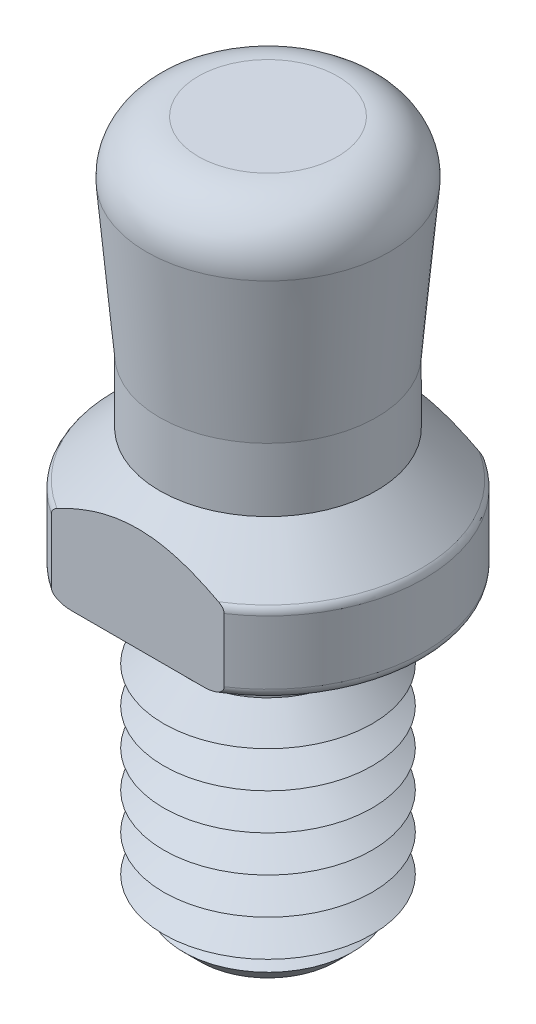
ISO-10303-21;
HEADER;
FILE_DESCRIPTION(('STEP AP214'),'2;1');
FILE_NAME('part.step','',(''),(''),'','','');
FILE_SCHEMA(('AUTOMOTIVE_DESIGN { 1 0 10303 214 1 1 1 1 }'));
ENDSEC;
DATA;
#1=APPLICATION_CONTEXT('core data for automotive mechanical design processes');
#2=APPLICATION_PROTOCOL_DEFINITION('international standard','automotive_design',2000,#1);
#3=PRODUCT_CONTEXT('',#1,'mechanical');
#4=PRODUCT('Part','Part','',(#3));
#5=PRODUCT_RELATED_PRODUCT_CATEGORY('part','',(#4));
#6=PRODUCT_DEFINITION_FORMATION('','',#4);
#7=PRODUCT_DEFINITION_CONTEXT('part definition',#1,'design');
#8=PRODUCT_DEFINITION('design','',#6,#7);
#9=PRODUCT_DEFINITION_SHAPE('','',#8);
#10=(LENGTH_UNIT() NAMED_UNIT(*) SI_UNIT(.MILLI.,.METRE.));
#11=(NAMED_UNIT(*) PLANE_ANGLE_UNIT() SI_UNIT($,.RADIAN.));
#12=(NAMED_UNIT(*) SI_UNIT($,.STERADIAN.) SOLID_ANGLE_UNIT());
#13=UNCERTAINTY_MEASURE_WITH_UNIT(LENGTH_MEASURE(1.E-05),#10,'distance_accuracy_value','');
#14=(GEOMETRIC_REPRESENTATION_CONTEXT(3) GLOBAL_UNCERTAINTY_ASSIGNED_CONTEXT((#13)) GLOBAL_UNIT_ASSIGNED_CONTEXT((#10,
#11,#12)) REPRESENTATION_CONTEXT('',''));
#15=CARTESIAN_POINT('',(0.,0.,0.));
#16=DIRECTION('',(0.,0.,1.));
#17=DIRECTION('',(1.,0.,0.));
#18=AXIS2_PLACEMENT_3D('',#15,#16,#17);
#19=CARTESIAN_POINT('',(0.,0.,0.));
#20=DIRECTION('',(0.,-1.,0.));
#21=DIRECTION('',(0.,0.,-1.));
#22=AXIS2_PLACEMENT_3D('',#19,#20,#21);
#23=PLANE('',#22);
#24=CARTESIAN_POINT('',(0.,0.,0.));
#25=DIRECTION('',(0.,-1.,0.));
#26=DIRECTION('',(0.,0.,-1.));
#27=AXIS2_PLACEMENT_3D('',#24,#25,#26);
#28=CIRCLE('',#27,1.50502525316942);
#29=CARTESIAN_POINT('',(0.,0.,-1.50502525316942));
#30=VERTEX_POINT('',#29);
#31=EDGE_CURVE('E44',#30,#30,#28,.T.);
#32=ORIENTED_EDGE('',*,*,#31,.F.);
#33=EDGE_LOOP('',(#32));
#34=FACE_BOUND('',#33,.T.);
#35=CARTESIAN_POINT('',(0.,0.,0.));
#36=DIRECTION('',(0.,1.,0.));
#37=DIRECTION('',(0.,0.,1.));
#38=AXIS2_PLACEMENT_3D('',#35,#36,#37);
#39=CIRCLE('',#38,2.8);
#40=CARTESIAN_POINT('',(1.26095202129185,0.,2.5));
#41=VERTEX_POINT('',#40);
#42=CARTESIAN_POINT('',(1.26095202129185,0.,-2.5));
#43=VERTEX_POINT('',#42);
#44=EDGE_CURVE('E123',#41,#43,#39,.T.);
#45=ORIENTED_EDGE('',*,*,#44,.F.);
#46=DIRECTION('',(-1.,0.,0.));
#47=VECTOR('',#46,1.);
#48=CARTESIAN_POINT('',(-2.09737953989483,0.,2.5));
#49=LINE('',#48,#47);
#50=CARTESIAN_POINT('',(-1.26095202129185,0.,2.5));
#51=VERTEX_POINT('',#50);
#52=EDGE_CURVE('E110',#41,#51,#49,.T.);
#53=ORIENTED_EDGE('',*,*,#52,.T.);
#54=CARTESIAN_POINT('',(-1.26095202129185,0.,-2.5));
#55=VERTEX_POINT('',#54);
#56=EDGE_CURVE('E118',#55,#51,#39,.T.);
#57=ORIENTED_EDGE('',*,*,#56,.F.);
#58=DIRECTION('',(1.,0.,0.));
#59=VECTOR('',#58,1.);
#60=CARTESIAN_POINT('',(2.09737953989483,0.,-2.5));
#61=LINE('',#60,#59);
#62=EDGE_CURVE('E99',#55,#43,#61,.T.);
#63=ORIENTED_EDGE('',*,*,#62,.T.);
#64=EDGE_LOOP('',(#45,#53,#57,#63));
#65=FACE_BOUND('',#64,.T.);
#66=ADVANCED_FACE('F35',(#34,#65),#23,.T.);
#67=CARTESIAN_POINT('',(0.,0.2,0.));
#68=DIRECTION('',(0.,1.,0.));
#69=DIRECTION('',(0.,0.,1.));
#70=AXIS2_PLACEMENT_3D('',#67,#68,#69);
#71=TOROIDAL_SURFACE('',#70,2.8,0.2);
#72=ORIENTED_EDGE('',*,*,#56,.T.);
#73=CARTESIAN_POINT('',(-1.65727901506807,0.184896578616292,2.5));
#74=CARTESIAN_POINT('',(-1.6582631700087,0.192083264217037,2.5));
#75=CARTESIAN_POINT('',(-1.65854794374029,0.199381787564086,2.5));
#76=CARTESIAN_POINT('',(-1.65767777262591,0.21390062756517,2.5));
#77=CARTESIAN_POINT('',(-1.6565193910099,0.221120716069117,2.5));
#78=CARTESIAN_POINT('',(-1.65290046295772,0.235163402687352,2.5));
#79=CARTESIAN_POINT('',(-1.65044960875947,0.241988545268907,2.5));
#80=CARTESIAN_POINT('',(-1.64446841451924,0.255139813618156,2.5));
#81=CARTESIAN_POINT('',(-1.64093756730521,0.261465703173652,2.5));
#82=CARTESIAN_POINT('',(-1.6314305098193,0.275989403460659,2.5));
#83=CARTESIAN_POINT('',(-1.6250420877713,0.283915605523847,2.5));
#84=CARTESIAN_POINT('',(-1.61111070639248,0.298673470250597,2.5));
#85=CARTESIAN_POINT('',(-1.60356506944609,0.305502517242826,2.5));
#86=CARTESIAN_POINT('',(-1.58257960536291,0.322245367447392,2.5));
#87=CARTESIAN_POINT('',(-1.56847181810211,0.331315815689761,2.5));
#88=CARTESIAN_POINT('',(-1.5390972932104,0.347288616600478,2.5));
#89=CARTESIAN_POINT('',(-1.52382796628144,0.354185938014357,2.5));
#90=CARTESIAN_POINT('',(-1.4792426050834,0.371406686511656,2.5));
#91=CARTESIAN_POINT('',(-1.44911007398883,0.379595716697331,2.5));
#92=CARTESIAN_POINT('',(-1.38800406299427,0.391679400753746,2.5));
#93=CARTESIAN_POINT('',(-1.35702816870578,0.395560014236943,2.5));
#94=CARTESIAN_POINT('',(-1.29697696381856,0.399806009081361,2.5));
#95=CARTESIAN_POINT('',(-1.26791625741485,0.400393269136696,2.5));
#96=CARTESIAN_POINT('',(-1.20983112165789,0.399119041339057,2.5));
#97=CARTESIAN_POINT('',(-1.18080675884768,0.397255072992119,2.5));
#98=CARTESIAN_POINT('',(-1.12300872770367,0.391356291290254,2.5));
#99=CARTESIAN_POINT('',(-1.09423485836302,0.387323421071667,2.5));
#100=CARTESIAN_POINT('',(-1.03707981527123,0.377195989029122,2.5));
#101=CARTESIAN_POINT('',(-1.00869834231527,0.371103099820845,2.5));
#102=CARTESIAN_POINT('',(-0.951404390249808,0.356492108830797,2.5));
#103=CARTESIAN_POINT('',(-0.922512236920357,0.347891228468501,2.5));
#104=CARTESIAN_POINT('',(-0.879891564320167,0.332794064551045,2.5));
#105=CARTESIAN_POINT('',(-0.865776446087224,0.327382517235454,2.5));
#106=CARTESIAN_POINT('',(-0.837934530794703,0.315646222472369,2.5));
#107=CARTESIAN_POINT('',(-0.824207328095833,0.309322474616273,2.5));
#108=CARTESIAN_POINT('',(-0.797249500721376,0.295369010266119,2.5));
#109=CARTESIAN_POINT('',(-0.784026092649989,0.28772555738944,2.5));
#110=CARTESIAN_POINT('',(-0.758885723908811,0.270547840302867,2.5));
#111=CARTESIAN_POINT('',(-0.746955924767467,0.26103543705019,2.5));
#112=CARTESIAN_POINT('',(-0.733704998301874,0.24645207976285,2.5));
#113=CARTESIAN_POINT('',(-0.73077250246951,0.242887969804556,2.5));
#114=CARTESIAN_POINT('',(-0.725419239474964,0.23539011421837,2.5));
#115=CARTESIAN_POINT('',(-0.722997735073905,0.231456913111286,2.5));
#116=CARTESIAN_POINT('',(-0.719402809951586,0.22423521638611,2.5));
#117=CARTESIAN_POINT('',(-0.718068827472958,0.221027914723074,2.5));
#118=CARTESIAN_POINT('',(-0.715941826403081,0.214438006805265,2.5));
#119=CARTESIAN_POINT('',(-0.71514806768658,0.211055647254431,2.5));
#120=CARTESIAN_POINT('',(-0.714193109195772,0.20417343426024,2.5));
#121=CARTESIAN_POINT('',(-0.714036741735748,0.200672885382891,2.5));
#122=CARTESIAN_POINT('',(-0.714392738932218,0.193706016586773,2.5));
#123=CARTESIAN_POINT('',(-0.714905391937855,0.190239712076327,2.5));
#124=CARTESIAN_POINT('',(-0.716617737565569,0.183086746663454,2.5));
#125=CARTESIAN_POINT('',(-0.717885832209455,0.179416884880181,2.5));
#126=CARTESIAN_POINT('',(-0.720997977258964,0.172331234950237,2.5));
#127=CARTESIAN_POINT('',(-0.722843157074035,0.168915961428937,2.5));
#128=CARTESIAN_POINT('',(-0.728277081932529,0.160237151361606,2.5));
#129=CARTESIAN_POINT('',(-0.732223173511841,0.155200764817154,2.5));
#130=CARTESIAN_POINT('',(-0.740782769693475,0.14573719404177,2.5));
#131=CARTESIAN_POINT('',(-0.745398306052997,0.141311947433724,2.5));
#132=CARTESIAN_POINT('',(-0.757122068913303,0.131134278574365,2.5));
#133=CARTESIAN_POINT('',(-0.764446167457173,0.125633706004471,2.5));
#134=CARTESIAN_POINT('',(-0.779577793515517,0.115333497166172,2.5));
#135=CARTESIAN_POINT('',(-0.787386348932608,0.110535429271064,2.5));
#136=CARTESIAN_POINT('',(-0.811333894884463,0.096892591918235,2.5));
#137=CARTESIAN_POINT('',(-0.827926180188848,0.0888513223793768,2.5));
#138=CARTESIAN_POINT('',(-0.870210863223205,0.0704499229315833,2.5));
#139=CARTESIAN_POINT('',(-0.89626984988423,0.0609676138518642,2.5));
#140=CARTESIAN_POINT('',(-0.9491212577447,0.0442001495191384,2.5));
#141=CARTESIAN_POINT('',(-0.975915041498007,0.0369194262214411,2.5));
#142=CARTESIAN_POINT('',(-1.02994727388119,0.0242919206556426,2.5));
#143=CARTESIAN_POINT('',(-1.05718564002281,0.018944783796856,2.5));
#144=CARTESIAN_POINT('',(-1.11196758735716,0.0101442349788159,2.5));
#145=CARTESIAN_POINT('',(-1.13951119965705,0.00669101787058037,2.5));
#146=CARTESIAN_POINT('',(-1.20926503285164,0.00050927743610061,2.5));
#147=CARTESIAN_POINT('',(-1.25160072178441,-0.000892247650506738,2.5));
#148=CARTESIAN_POINT('',(-1.33596168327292,0.00200938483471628,2.5));
#149=CARTESIAN_POINT('',(-1.3779873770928,0.00628101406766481,2.5));
#150=CARTESIAN_POINT('',(-1.43603207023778,0.0178426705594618,2.5));
#151=CARTESIAN_POINT('',(-1.45270715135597,0.0218448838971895,2.5));
#152=CARTESIAN_POINT('',(-1.48564989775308,0.0314439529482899,2.5));
#153=CARTESIAN_POINT('',(-1.50191652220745,0.0370445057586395,2.5));
#154=CARTESIAN_POINT('',(-1.53384309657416,0.0502503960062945,2.5));
#155=CARTESIAN_POINT('',(-1.54949424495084,0.0578774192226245,2.5));
#156=CARTESIAN_POINT('',(-1.57933244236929,0.0755955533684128,2.5));
#157=CARTESIAN_POINT('',(-1.59352604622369,0.085674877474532,2.5));
#158=CARTESIAN_POINT('',(-1.61256492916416,0.10287019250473,2.5));
#159=CARTESIAN_POINT('',(-1.61845285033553,0.10882883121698,2.5));
#160=CARTESIAN_POINT('',(-1.62935639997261,0.121510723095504,2.5));
#161=CARTESIAN_POINT('',(-1.63437235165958,0.128233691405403,2.5));
#162=CARTESIAN_POINT('',(-1.64256418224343,0.141376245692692,2.5));
#163=CARTESIAN_POINT('',(-1.64590244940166,0.147693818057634,2.5));
#164=CARTESIAN_POINT('',(-1.65148810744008,0.160785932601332,2.5));
#165=CARTESIAN_POINT('',(-1.65373909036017,0.167558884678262,2.5));
#166=CARTESIAN_POINT('',(-1.65575234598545,0.17619260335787,2.5));
#167=CARTESIAN_POINT('',(-1.65611412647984,0.17792272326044,2.5));
#168=CARTESIAN_POINT('',(-1.65675749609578,0.181398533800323,2.5));
#169=CARTESIAN_POINT('',(-1.65703904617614,0.183144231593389,2.5));
#170=CARTESIAN_POINT('',(-1.65727901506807,0.184896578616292,2.5));
#171=B_SPLINE_CURVE_WITH_KNOTS('',3,(#73,#74,#75,#76,#77,#78,#79,#80,#81,#82,#83,#84,#85,#86,
#87,#88,#89,#90,#91,#92,#93,#94,#95,#96,#97,#98,#99,#100,#101,#102,#103,#104,#105,#106,#107,
#108,#109,#110,#111,#112,#113,#114,#115,#116,#117,#118,#119,#120,#121,#122,#123,#124,#125,#126,
#127,#128,#129,#130,#131,#132,#133,#134,#135,#136,#137,#138,#139,#140,#141,#142,#143,#144,#145,
#146,#147,#148,#149,#150,#151,#152,#153,#154,#155,#156,#157,#158,#159,#160,#161,#162,#163,#164,
#165,#166,#167,#168,#169,#170),.UNSPECIFIED.,.T.,.F.,(4,2,2,2,2,2,2,2,2,2,2,2,2,2,2,2,2,2,2,2,2,
2,2,2,2,2,2,2,2,2,2,2,2,2,2,2,2,2,2,2,2,2,2,2,2,2,2,2,4),(0.,0.0217519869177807,
0.0435558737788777,0.0651985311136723,0.0868513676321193,0.117220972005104,0.147661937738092,
0.197694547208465,0.247842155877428,0.340995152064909,0.434450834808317,0.521526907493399,
0.608691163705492,0.695777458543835,0.782793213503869,0.873089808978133,0.918421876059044,
0.96370464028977,1.00949079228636,1.05477024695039,1.06858603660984,1.08238175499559,
1.09276488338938,1.10313375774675,1.11358109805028,1.12403294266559,1.13561687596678,
1.14722362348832,1.16630963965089,1.18545484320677,1.21286565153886,1.24033675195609,
1.29553496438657,1.37859038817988,1.46181191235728,1.54501816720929,1.62823298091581,
1.75503488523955,1.88113503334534,1.93252348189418,1.98403177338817,2.03611516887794,
2.08795300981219,2.11302335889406,2.13808439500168,2.1594415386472,2.18072763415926,
2.18602889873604,2.19133273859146),.UNSPECIFIED.);
#172=CARTESIAN_POINT('',(-1.6583123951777,0.200000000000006,2.5));
#173=VERTEX_POINT('',#172);
#174=EDGE_CURVE('E202',#51,#173,#171,.T.);
#175=ORIENTED_EDGE('',*,*,#174,.T.);
#176=CARTESIAN_POINT('',(0.,0.200000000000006,0.));
#177=DIRECTION('',(0.,1.,0.));
#178=DIRECTION('',(0.,0.,1.));
#179=AXIS2_PLACEMENT_3D('',#176,#177,#178);
#180=CIRCLE('',#179,3.);
#181=CARTESIAN_POINT('',(-1.6583123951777,0.200000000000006,-2.5));
#182=VERTEX_POINT('',#181);
#183=EDGE_CURVE('E120',#182,#173,#180,.T.);
#184=ORIENTED_EDGE('',*,*,#183,.F.);
#185=CARTESIAN_POINT('',(-1.65727901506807,0.184896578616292,-2.5));
#186=CARTESIAN_POINT('',(-1.6563202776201,0.177903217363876,-2.5));
#187=CARTESIAN_POINT('',(-1.65469859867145,0.171000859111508,-2.5));
#188=CARTESIAN_POINT('',(-1.65028479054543,0.157581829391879,-2.5));
#189=CARTESIAN_POINT('',(-1.64749112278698,0.151065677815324,-2.5));
#190=CARTESIAN_POINT('',(-1.64003433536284,0.136795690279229,-2.5));
#191=CARTESIAN_POINT('',(-1.63506733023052,0.129202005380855,-2.5));
#192=CARTESIAN_POINT('',(-1.62399128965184,0.114906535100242,-2.5));
#193=CARTESIAN_POINT('',(-1.61788024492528,0.108206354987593,-2.5));
#194=CARTESIAN_POINT('',(-1.60116462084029,0.0921083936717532,-2.5));
#195=CARTESIAN_POINT('',(-1.58997210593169,0.0833255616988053,-2.5));
#196=CARTESIAN_POINT('',(-1.56641127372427,0.0675278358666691,-2.5));
#197=CARTESIAN_POINT('',(-1.55403996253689,0.0605176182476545,-2.5));
#198=CARTESIAN_POINT('',(-1.51833427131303,0.0429047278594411,-2.5));
#199=CARTESIAN_POINT('',(-1.49419243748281,0.0339536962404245,-2.5));
#200=CARTESIAN_POINT('',(-1.44493359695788,0.0195596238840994,-2.5));
#201=CARTESIAN_POINT('',(-1.41981507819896,0.0141222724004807,-2.5));
#202=CARTESIAN_POINT('',(-1.37032846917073,0.00617750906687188,-2.5));
#203=CARTESIAN_POINT('',(-1.3459796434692,0.00354584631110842,-2.5));
#204=CARTESIAN_POINT('',(-1.29713342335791,0.000340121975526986,-2.5));
#205=CARTESIAN_POINT('',(-1.27263590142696,-0.000231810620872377,-2.5));
#206=CARTESIAN_POINT('',(-1.2235261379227,0.00039846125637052,-2.5));
#207=CARTESIAN_POINT('',(-1.1989140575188,0.00161100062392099,-2.5));
#208=CARTESIAN_POINT('',(-1.14984546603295,0.00563870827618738,-2.5));
#209=CARTESIAN_POINT('',(-1.12538884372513,0.00845255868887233,-2.5));
#210=CARTESIAN_POINT('',(-1.07419240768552,0.0159466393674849,-2.5));
#211=CARTESIAN_POINT('',(-1.04747616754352,0.0207889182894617,-2.5));
#212=CARTESIAN_POINT('',(-0.994383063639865,0.0323111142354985,-2.5));
#213=CARTESIAN_POINT('',(-0.968007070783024,0.0389950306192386,-2.5));
#214=CARTESIAN_POINT('',(-0.915963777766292,0.0543576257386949,-2.5));
#215=CARTESIAN_POINT('',(-0.890293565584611,0.0630260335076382,-2.5));
#216=CARTESIAN_POINT('',(-0.85263236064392,0.0780250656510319,-2.5));
#217=CARTESIAN_POINT('',(-0.840239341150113,0.0833469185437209,-2.5));
#218=CARTESIAN_POINT('',(-0.815861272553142,0.0948463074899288,-2.5));
#219=CARTESIAN_POINT('',(-0.803875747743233,0.10102279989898,-2.5));
#220=CARTESIAN_POINT('',(-0.781829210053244,0.11384063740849,-2.5));
#221=CARTESIAN_POINT('',(-0.771699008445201,0.120362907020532,-2.5));
#222=CARTESIAN_POINT('',(-0.752494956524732,0.134765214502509,-2.5));
#223=CARTESIAN_POINT('',(-0.743411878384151,0.142631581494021,-2.5));
#224=CARTESIAN_POINT('',(-0.732850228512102,0.154591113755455,-2.5));
#225=CARTESIAN_POINT('',(-0.730317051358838,0.157736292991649,-2.5));
#226=CARTESIAN_POINT('',(-0.72563973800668,0.164315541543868,-2.5));
#227=CARTESIAN_POINT('',(-0.723496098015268,0.167749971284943,-2.5));
#228=CARTESIAN_POINT('',(-0.719729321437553,0.174964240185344,-2.5));
#229=CARTESIAN_POINT('',(-0.718114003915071,0.178748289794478,-2.5));
#230=CARTESIAN_POINT('',(-0.715650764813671,0.18655566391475,-2.5));
#231=CARTESIAN_POINT('',(-0.71480034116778,0.190578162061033,-2.5));
#232=CARTESIAN_POINT('',(-0.714052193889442,0.198251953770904,-2.5));
#233=CARTESIAN_POINT('',(-0.714057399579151,0.201893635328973,-2.5));
#234=CARTESIAN_POINT('',(-0.714779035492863,0.209107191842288,-2.5));
#235=CARTESIAN_POINT('',(-0.715496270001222,0.212678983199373,-2.5));
#236=CARTESIAN_POINT('',(-0.717672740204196,0.220079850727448,-2.5));
#237=CARTESIAN_POINT('',(-0.719214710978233,0.223883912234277,-2.5));
#238=CARTESIAN_POINT('',(-0.722882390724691,0.231196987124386,-2.5));
#239=CARTESIAN_POINT('',(-0.725009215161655,0.234705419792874,-2.5));
#240=CARTESIAN_POINT('',(-0.731370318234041,0.243874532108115,-2.5));
#241=CARTESIAN_POINT('',(-0.736013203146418,0.249247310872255,-2.5));
#242=CARTESIAN_POINT('',(-0.745989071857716,0.259301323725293,-2.5));
#243=CARTESIAN_POINT('',(-0.751324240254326,0.263980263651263,-2.5));
#244=CARTESIAN_POINT('',(-0.765201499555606,0.275032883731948,-2.5));
#245=CARTESIAN_POINT('',(-0.774005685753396,0.281073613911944,-2.5));
#246=CARTESIAN_POINT('',(-0.792132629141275,0.292331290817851,-2.5));
#247=CARTESIAN_POINT('',(-0.80145651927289,0.297546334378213,-2.5));
#248=CARTESIAN_POINT('',(-0.829992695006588,0.312317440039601,-2.5));
#249=CARTESIAN_POINT('',(-0.849683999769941,0.320940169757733,-2.5));
#250=CARTESIAN_POINT('',(-0.897764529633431,0.339710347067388,-2.5));
#251=CARTESIAN_POINT('',(-0.926450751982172,0.349064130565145,-2.5));
#252=CARTESIAN_POINT('',(-0.984540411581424,0.365364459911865,-2.5));
#253=CARTESIAN_POINT('',(-1.01394505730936,0.372306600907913,-2.5));
#254=CARTESIAN_POINT('',(-1.07310902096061,0.383940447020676,-2.5));
#255=CARTESIAN_POINT('',(-1.10286710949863,0.388638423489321,-2.5));
#256=CARTESIAN_POINT('',(-1.16265487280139,0.395742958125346,-2.5));
#257=CARTESIAN_POINT('',(-1.19268450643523,0.398149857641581,-2.5));
#258=CARTESIAN_POINT('',(-1.25560296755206,0.400507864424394,-2.5));
#259=CARTESIAN_POINT('',(-1.28850191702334,0.400214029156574,-2.5));
#260=CARTESIAN_POINT('',(-1.35406928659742,0.395935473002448,-2.5));
#261=CARTESIAN_POINT('',(-1.38673793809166,0.391955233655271,-2.5));
#262=CARTESIAN_POINT('',(-1.44064153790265,0.381252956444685,-2.5));
#263=CARTESIAN_POINT('',(-1.46213454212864,0.375846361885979,-2.5));
#264=CARTESIAN_POINT('',(-1.50424276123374,0.362268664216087,-2.5));
#265=CARTESIAN_POINT('',(-1.52485974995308,0.354103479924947,-2.5));
#266=CARTESIAN_POINT('',(-1.55548398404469,0.338613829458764,-2.5));
#267=CARTESIAN_POINT('',(-1.5661207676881,0.332539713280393,-2.5));
#268=CARTESIAN_POINT('',(-1.58654450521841,0.319078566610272,-2.5));
#269=CARTESIAN_POINT('',(-1.59633214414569,0.311692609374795,-2.5));
#270=CARTESIAN_POINT('',(-1.61236101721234,0.297379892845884,-2.5));
#271=CARTESIAN_POINT('',(-1.61888707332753,0.290775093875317,-2.5));
#272=CARTESIAN_POINT('',(-1.63084318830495,0.276632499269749,-2.5));
#273=CARTESIAN_POINT('',(-1.63627518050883,0.269096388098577,-2.5));
#274=CARTESIAN_POINT('',(-1.64444141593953,0.255132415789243,-2.5));
#275=CARTESIAN_POINT('',(-1.64751056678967,0.248901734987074,-2.5));
#276=CARTESIAN_POINT('',(-1.65258908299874,0.236021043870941,-2.5));
#277=CARTESIAN_POINT('',(-1.65459968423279,0.229371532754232,-2.5));
#278=CARTESIAN_POINT('',(-1.65726897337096,0.216406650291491,-2.5));
#279=CARTESIAN_POINT('',(-1.6580300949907,0.210112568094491,-2.5));
#280=CARTESIAN_POINT('',(-1.6584640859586,0.197486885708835,-2.5));
#281=CARTESIAN_POINT('',(-1.65813703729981,0.191155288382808,-2.5));
#282=CARTESIAN_POINT('',(-1.65727901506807,0.184896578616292,-2.5));
#283=B_SPLINE_CURVE_WITH_KNOTS('',3,(#185,#186,#187,#188,#189,#190,#191,#192,#193,#194,#195,
#196,#197,#198,#199,#200,#201,#202,#203,#204,#205,#206,#207,#208,#209,#210,#211,#212,#213,#214,
#215,#216,#217,#218,#219,#220,#221,#222,#223,#224,#225,#226,#227,#228,#229,#230,#231,#232,#233,
#234,#235,#236,#237,#238,#239,#240,#241,#242,#243,#244,#245,#246,#247,#248,#249,#250,#251,#252,
#253,#254,#255,#256,#257,#258,#259,#260,#261,#262,#263,#264,#265,#266,#267,#268,#269,#270,#271,
#272,#273,#274,#275,#276,#277,#278,#279,#280,#281,#282),.UNSPECIFIED.,.T.,.F.,(4,2,2,2,2,2,2,2,
2,2,2,2,2,2,2,2,2,2,2,2,2,2,2,2,2,2,2,2,2,2,2,2,2,2,2,2,2,2,2,2,2,2,2,2,2,2,2,2,4),(0.,
0.02114942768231,0.0423267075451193,0.0693968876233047,0.0965150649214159,0.138956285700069,
0.181508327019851,0.258319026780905,0.335253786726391,0.408618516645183,0.482059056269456,
0.555926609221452,0.629733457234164,0.711123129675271,0.792690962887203,0.873845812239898,
0.914288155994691,0.954681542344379,0.990784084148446,1.02653918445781,1.03863271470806,
1.05074154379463,1.0630222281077,1.07526259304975,1.08611537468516,1.09698042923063,
1.10922668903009,1.12149646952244,1.14267920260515,1.16393048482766,1.19588237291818,
1.22790686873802,1.29226521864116,1.38265131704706,1.47320164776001,1.56349743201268,
1.65377976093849,1.75232561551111,1.85075182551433,1.91711667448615,1.98334002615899,
2.02001620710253,2.05666251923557,2.08443413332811,2.1121562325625,2.13291419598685,
2.15364787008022,2.17257698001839,2.19150466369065),.UNSPECIFIED.);
#284=EDGE_CURVE('E102',#182,#55,#283,.T.);
#285=ORIENTED_EDGE('',*,*,#284,.T.);
#286=EDGE_LOOP('',(#72,#175,#184,#285));
#287=FACE_BOUND('',#286,.T.);
#288=ADVANCED_FACE('F116',(#287),#71,.T.);
#289=CARTESIAN_POINT('',(1.6583123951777,0.200000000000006,2.5));
#290=VERTEX_POINT('',#289);
#291=CARTESIAN_POINT('',(1.6583123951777,0.200000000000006,-2.5));
#292=VERTEX_POINT('',#291);
#293=EDGE_CURVE('E124',#290,#292,#180,.T.);
#294=ORIENTED_EDGE('',*,*,#293,.F.);
#295=CARTESIAN_POINT('',(0.714355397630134,0.204832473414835,2.5));
#296=CARTESIAN_POINT('',(0.714715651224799,0.208921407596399,2.5));
#297=CARTESIAN_POINT('',(0.715535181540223,0.212970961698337,2.5));
#298=CARTESIAN_POINT('',(0.717951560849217,0.220833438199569,2.5));
#299=CARTESIAN_POINT('',(0.719551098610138,0.224645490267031,2.5));
#300=CARTESIAN_POINT('',(0.723981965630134,0.233241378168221,2.5));
#301=CARTESIAN_POINT('',(0.727048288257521,0.237901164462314,2.5));
#302=CARTESIAN_POINT('',(0.733841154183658,0.246702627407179,2.5));
#303=CARTESIAN_POINT('',(0.737569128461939,0.250843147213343,2.5));
#304=CARTESIAN_POINT('',(0.751511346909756,0.264788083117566,2.5));
#305=CARTESIAN_POINT('',(0.762841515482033,0.273450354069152,2.5));
#306=CARTESIAN_POINT('',(0.786549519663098,0.289193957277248,2.5));
#307=CARTESIAN_POINT('',(0.798933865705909,0.296264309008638,2.5));
#308=CARTESIAN_POINT('',(0.831540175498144,0.313078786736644,2.5));
#309=CARTESIAN_POINT('',(0.852175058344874,0.322023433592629,2.5));
#310=CARTESIAN_POINT('',(0.89413011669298,0.338162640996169,2.5));
#311=CARTESIAN_POINT('',(0.915451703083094,0.345353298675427,2.5));
#312=CARTESIAN_POINT('',(0.958531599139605,0.358316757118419,2.5));
#313=CARTESIAN_POINT('',(0.980290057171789,0.364089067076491,2.5));
#314=CARTESIAN_POINT('',(1.02410813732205,0.374356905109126,2.5));
#315=CARTESIAN_POINT('',(1.04616790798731,0.378851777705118,2.5));
#316=CARTESIAN_POINT('',(1.11724860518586,0.391290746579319,2.5));
#317=CARTESIAN_POINT('',(1.16672807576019,0.396864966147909,2.5));
#318=CARTESIAN_POINT('',(1.24110982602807,0.400091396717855,2.5));
#319=CARTESIAN_POINT('',(1.26592213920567,0.400311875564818,2.5));
#320=CARTESIAN_POINT('',(1.31547932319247,0.398772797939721,2.5));
#321=CARTESIAN_POINT('',(1.34022423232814,0.397014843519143,2.5));
#322=CARTESIAN_POINT('',(1.39325827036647,0.390694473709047,2.5));
#323=CARTESIAN_POINT('',(1.42150258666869,0.38573978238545,2.5));
#324=CARTESIAN_POINT('',(1.47694345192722,0.371793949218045,2.5));
#325=CARTESIAN_POINT('',(1.5041446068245,0.362823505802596,2.5));
#326=CARTESIAN_POINT('',(1.54049182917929,0.346350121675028,2.5));
#327=CARTESIAN_POINT('',(1.5506958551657,0.341184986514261,2.5));
#328=CARTESIAN_POINT('',(1.57052223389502,0.32978726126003,2.5));
#329=CARTESIAN_POINT('',(1.58014371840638,0.323553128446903,2.5));
#330=CARTESIAN_POINT('',(1.59859309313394,0.30977918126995,2.5));
#331=CARTESIAN_POINT('',(1.60741054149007,0.302225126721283,2.5));
#332=CARTESIAN_POINT('',(1.62360547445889,0.285701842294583,2.5));
#333=CARTESIAN_POINT('',(1.63098792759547,0.276737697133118,2.5));
#334=CARTESIAN_POINT('',(1.6410883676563,0.261188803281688,2.5));
#335=CARTESIAN_POINT('',(1.64449886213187,0.25505515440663,2.5));
#336=CARTESIAN_POINT('',(1.65030590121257,0.242321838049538,2.5));
#337=CARTESIAN_POINT('',(1.65270334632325,0.235722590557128,2.5));
#338=CARTESIAN_POINT('',(1.65630356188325,0.222142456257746,2.5));
#339=CARTESIAN_POINT('',(1.65749660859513,0.215158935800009,2.5));
#340=CARTESIAN_POINT('',(1.65853066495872,0.20109241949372,2.5));
#341=CARTESIAN_POINT('',(1.65837227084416,0.194009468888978,2.5));
#342=CARTESIAN_POINT('',(1.65681025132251,0.18074025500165,2.5));
#343=CARTESIAN_POINT('',(1.65553876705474,0.174537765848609,2.5));
#344=CARTESIAN_POINT('',(1.65203186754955,0.162413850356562,2.5));
#345=CARTESIAN_POINT('',(1.64979600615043,0.156492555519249,2.5));
#346=CARTESIAN_POINT('',(1.6435664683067,0.142999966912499,2.5));
#347=CARTESIAN_POINT('',(1.63923067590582,0.135587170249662,2.5));
#348=CARTESIAN_POINT('',(1.62942770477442,0.121554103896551,2.5));
#349=CARTESIAN_POINT('',(1.62395814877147,0.114935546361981,2.5));
#350=CARTESIAN_POINT('',(1.60908824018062,0.0991850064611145,2.5));
#351=CARTESIAN_POINT('',(1.59913883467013,0.0905749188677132,2.5));
#352=CARTESIAN_POINT('',(1.5780668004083,0.0749533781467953,2.5));
#353=CARTESIAN_POINT('',(1.56694145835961,0.0679457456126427,2.5));
#354=CARTESIAN_POINT('',(1.53506873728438,0.0503717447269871,2.5));
#355=CARTESIAN_POINT('',(1.51353446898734,0.0412448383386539,2.5));
#356=CARTESIAN_POINT('',(1.4694157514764,0.026147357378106,2.5));
#357=CARTESIAN_POINT('',(1.44682906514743,0.0201838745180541,2.5));
#358=CARTESIAN_POINT('',(1.40216451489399,0.0109488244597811,2.5));
#359=CARTESIAN_POINT('',(1.38010820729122,0.00757004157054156,2.5));
#360=CARTESIAN_POINT('',(1.33578126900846,0.00268555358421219,2.5));
#361=CARTESIAN_POINT('',(1.31351045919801,0.00118158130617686,2.5));
#362=CARTESIAN_POINT('',(1.24650856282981,-0.000945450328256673,2.5));
#363=CARTESIAN_POINT('',(1.20170025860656,0.000836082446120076,2.5));
#364=CARTESIAN_POINT('',(1.10767894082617,0.00998570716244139,2.5));
#365=CARTESIAN_POINT('',(1.05852657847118,0.0179495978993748,2.5));
#366=CARTESIAN_POINT('',(0.985967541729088,0.0344382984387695,2.5));
#367=CARTESIAN_POINT('',(0.962023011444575,0.0406746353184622,2.5));
#368=CARTESIAN_POINT('',(0.914649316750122,0.0548482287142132,2.5));
#369=CARTESIAN_POINT('',(0.891219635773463,0.0627836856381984,2.5));
#370=CARTESIAN_POINT('',(0.857947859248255,0.0758638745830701,2.5));
#371=CARTESIAN_POINT('',(0.84775692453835,0.0801251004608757,2.5));
#372=CARTESIAN_POINT('',(0.827595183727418,0.0891974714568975,2.5));
#373=CARTESIAN_POINT('',(0.817624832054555,0.0940096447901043,2.5));
#374=CARTESIAN_POINT('',(0.797272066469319,0.104728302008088,2.5));
#375=CARTESIAN_POINT('',(0.786919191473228,0.110691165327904,2.5));
#376=CARTESIAN_POINT('',(0.766939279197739,0.123721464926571,2.5));
#377=CARTESIAN_POINT('',(0.75730962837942,0.130784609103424,2.5));
#378=CARTESIAN_POINT('',(0.744847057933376,0.141893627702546,2.5));
#379=CARTESIAN_POINT('',(0.741385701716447,0.14522676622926,2.5));
#380=CARTESIAN_POINT('',(0.734814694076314,0.152241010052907,2.5));
#381=CARTESIAN_POINT('',(0.731705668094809,0.155922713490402,2.5));
#382=CARTESIAN_POINT('',(0.725972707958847,0.163743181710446,2.5));
#383=CARTESIAN_POINT('',(0.723356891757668,0.167888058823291,2.5));
#384=CARTESIAN_POINT('',(0.718958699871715,0.176597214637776,2.5));
#385=CARTESIAN_POINT('',(0.717172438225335,0.181159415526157,2.5));
#386=CARTESIAN_POINT('',(0.71516558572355,0.188957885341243,2.5));
#387=CARTESIAN_POINT('',(0.714617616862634,0.192109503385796,2.5));
#388=CARTESIAN_POINT('',(0.714072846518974,0.198459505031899,2.5));
#389=CARTESIAN_POINT('',(0.714075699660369,0.201657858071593,2.5));
#390=CARTESIAN_POINT('',(0.714355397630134,0.204832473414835,2.5));
#391=B_SPLINE_CURVE_WITH_KNOTS('',3,(#295,#296,#297,#298,#299,#300,#301,#302,#303,#304,#305,
#306,#307,#308,#309,#310,#311,#312,#313,#314,#315,#316,#317,#318,#319,#320,#321,#322,#323,#324,
#325,#326,#327,#328,#329,#330,#331,#332,#333,#334,#335,#336,#337,#338,#339,#340,#341,#342,#343,
#344,#345,#346,#347,#348,#349,#350,#351,#352,#353,#354,#355,#356,#357,#358,#359,#360,#361,#362,
#363,#364,#365,#366,#367,#368,#369,#370,#371,#372,#373,#374,#375,#376,#377,#378,#379,#380,#381,
#382,#383,#384,#385,#386,#387,#388,#389,#390),.UNSPECIFIED.,.T.,.F.,(4,2,2,2,2,2,2,2,2,2,2,2,2,
2,2,2,2,2,2,2,2,2,2,2,2,2,2,2,2,2,2,2,2,2,2,2,2,2,2,2,2,2,2,2,2,2,2,4),(0.,0.012296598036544,
0.0246358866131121,0.0412734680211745,0.0579474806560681,0.100404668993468,0.143146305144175,
0.210458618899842,0.277919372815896,0.345403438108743,0.412922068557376,0.561796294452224,
0.636181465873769,0.710506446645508,0.796345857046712,0.881747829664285,0.916010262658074,
0.950322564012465,0.985030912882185,1.01961685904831,1.04059794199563,1.06156033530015,
1.08269064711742,1.10381163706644,1.12272077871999,1.14163867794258,1.16725770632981,
1.19293100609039,1.23218177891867,1.27152518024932,1.34129779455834,1.41122616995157,
1.47806747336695,1.54497051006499,1.67911495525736,1.82808848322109,1.90227800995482,
1.97638934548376,2.00951658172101,2.04270668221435,2.07851499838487,2.11418697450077,
2.1285846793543,2.14300755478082,2.15765031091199,2.17222376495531,2.18177673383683,
2.19132371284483),.UNSPECIFIED.);
#392=EDGE_CURVE('E197',#290,#41,#391,.T.);
#393=ORIENTED_EDGE('',*,*,#392,.T.);
#394=ORIENTED_EDGE('',*,*,#44,.T.);
#395=CARTESIAN_POINT('',(0.714355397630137,0.204832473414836,-2.5));
#396=CARTESIAN_POINT('',(0.714048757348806,0.201343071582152,-2.5));
#397=CARTESIAN_POINT('',(0.714075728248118,0.197822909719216,-2.5));
#398=CARTESIAN_POINT('',(0.714793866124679,0.190849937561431,-2.5));
#399=CARTESIAN_POINT('',(0.715485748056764,0.187397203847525,-2.5));
#400=CARTESIAN_POINT('',(0.717433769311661,0.180694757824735,-2.5));
#401=CARTESIAN_POINT('',(0.718684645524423,0.177443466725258,-2.5));
#402=CARTESIAN_POINT('',(0.721629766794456,0.171151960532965,-2.5));
#403=CARTESIAN_POINT('',(0.723324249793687,0.168111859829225,-2.5));
#404=CARTESIAN_POINT('',(0.728655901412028,0.15970785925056,-2.5));
#405=CARTESIAN_POINT('',(0.732705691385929,0.154608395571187,-2.5));
#406=CARTESIAN_POINT('',(0.7414838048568,0.145029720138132,-2.5));
#407=CARTESIAN_POINT('',(0.746214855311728,0.140553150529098,-2.5));
#408=CARTESIAN_POINT('',(0.758251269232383,0.130239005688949,-2.5));
#409=CARTESIAN_POINT('',(0.765777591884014,0.124662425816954,-2.5));
#410=CARTESIAN_POINT('',(0.781318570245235,0.114227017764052,-2.5));
#411=CARTESIAN_POINT('',(0.789334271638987,0.109369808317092,-2.5));
#412=CARTESIAN_POINT('',(0.813903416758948,0.0955692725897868,-2.5));
#413=CARTESIAN_POINT('',(0.830913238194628,0.0874462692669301,-2.5));
#414=CARTESIAN_POINT('',(0.874060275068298,0.0689595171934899,-2.5));
#415=CARTESIAN_POINT('',(0.900556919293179,0.0594700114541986,-2.5));
#416=CARTESIAN_POINT('',(0.954283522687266,0.0427244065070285,-2.5));
#417=CARTESIAN_POINT('',(0.981514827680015,0.0354727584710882,-2.5));
#418=CARTESIAN_POINT('',(1.03641712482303,0.0229519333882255,-2.5));
#419=CARTESIAN_POINT('',(1.06408795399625,0.0176820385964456,-2.5));
#420=CARTESIAN_POINT('',(1.1197319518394,0.0090969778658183,-2.5));
#421=CARTESIAN_POINT('',(1.14770514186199,0.00578195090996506,-2.5));
#422=CARTESIAN_POINT('',(1.21647301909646,0.000218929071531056,-2.5));
#423=CARTESIAN_POINT('',(1.25736757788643,-0.000875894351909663,-2.5));
#424=CARTESIAN_POINT('',(1.33883319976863,0.0023107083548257,-2.5));
#425=CARTESIAN_POINT('',(1.37940481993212,0.0065632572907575,-2.5));
#426=CARTESIAN_POINT('',(1.43679960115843,0.0179955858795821,-2.5));
#427=CARTESIAN_POINT('',(1.45421357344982,0.0222078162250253,-2.5));
#428=CARTESIAN_POINT('',(1.48859855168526,0.0323902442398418,-2.5));
#429=CARTESIAN_POINT('',(1.50556799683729,0.0383659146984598,-2.5));
#430=CARTESIAN_POINT('',(1.53884136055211,0.0525668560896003,-2.5));
#431=CARTESIAN_POINT('',(1.55513247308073,0.0608227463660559,-2.5));
#432=CARTESIAN_POINT('',(1.58595683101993,0.0801244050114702,-2.5));
#433=CARTESIAN_POINT('',(1.60050103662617,0.0911512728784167,-2.5));
#434=CARTESIAN_POINT('',(1.61897179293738,0.109433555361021,-2.5));
#435=CARTESIAN_POINT('',(1.62426059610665,0.115308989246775,-2.5));
#436=CARTESIAN_POINT('',(1.63397829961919,0.127746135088,-2.5));
#437=CARTESIAN_POINT('',(1.63840713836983,0.134307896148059,-2.5));
#438=CARTESIAN_POINT('',(1.64617060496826,0.148166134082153,-2.5));
#439=CARTESIAN_POINT('',(1.64949156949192,0.155470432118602,-2.5));
#440=CARTESIAN_POINT('',(1.65464542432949,0.170586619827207,-2.5));
#441=CARTESIAN_POINT('',(1.65648105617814,0.178397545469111,-2.5));
#442=CARTESIAN_POINT('',(1.65832688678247,0.19326165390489,-2.5));
#443=CARTESIAN_POINT('',(1.6585330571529,0.200290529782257,-2.5));
#444=CARTESIAN_POINT('',(1.65761276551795,0.214260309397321,-2.5));
#445=CARTESIAN_POINT('',(1.65648621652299,0.221201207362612,-2.5));
#446=CARTESIAN_POINT('',(1.65319275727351,0.2340713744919,-2.5));
#447=CARTESIAN_POINT('',(1.65114350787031,0.240031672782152,-2.5));
#448=CARTESIAN_POINT('',(1.64620432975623,0.251588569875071,-2.5));
#449=CARTESIAN_POINT('',(1.64331419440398,0.257185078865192,-2.5));
#450=CARTESIAN_POINT('',(1.63510137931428,0.270861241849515,-2.5));
#451=CARTESIAN_POINT('',(1.62930649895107,0.278657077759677,-2.5));
#452=CARTESIAN_POINT('',(1.61656277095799,0.293241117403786,-2.5));
#453=CARTESIAN_POINT('',(1.60961076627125,0.3000264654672,-2.5));
#454=CARTESIAN_POINT('',(1.59041452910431,0.316527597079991,-2.5));
#455=CARTESIAN_POINT('',(1.57753381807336,0.32549784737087,-2.5));
#456=CARTESIAN_POINT('',(1.55060745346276,0.341435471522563,-2.5));
#457=CARTESIAN_POINT('',(1.53655933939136,0.348398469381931,-2.5));
#458=CARTESIAN_POINT('',(1.49571272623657,0.365856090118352,-2.5));
#459=CARTESIAN_POINT('',(1.4680963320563,0.374419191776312,-2.5));
#460=CARTESIAN_POINT('',(1.41194736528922,0.387586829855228,-2.5));
#461=CARTESIAN_POINT('',(1.38341222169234,0.392179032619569,-2.5));
#462=CARTESIAN_POINT('',(1.32759185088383,0.398096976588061,-2.5));
#463=CARTESIAN_POINT('',(1.30032320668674,0.399587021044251,-2.5));
#464=CARTESIAN_POINT('',(1.24574471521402,0.400263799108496,-2.5));
#465=CARTESIAN_POINT('',(1.21843485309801,0.399448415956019,-2.5));
#466=CARTESIAN_POINT('',(1.16397018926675,0.395807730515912,-2.5));
#467=CARTESIAN_POINT('',(1.13681530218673,0.392983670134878,-2.5));
#468=CARTESIAN_POINT('',(1.08276217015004,0.385478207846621,-2.5));
#469=CARTESIAN_POINT('',(1.05586398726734,0.380796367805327,-2.5));
#470=CARTESIAN_POINT('',(0.990370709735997,0.367084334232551,-2.5));
#471=CARTESIAN_POINT('',(0.951979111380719,0.357045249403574,-2.5));
#472=CARTESIAN_POINT('',(0.88761392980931,0.335970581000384,-2.5));
#473=CARTESIAN_POINT('',(0.861280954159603,0.326077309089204,-2.5));
#474=CARTESIAN_POINT('',(0.822797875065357,0.308578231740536,-2.5));
#475=CARTESIAN_POINT('',(0.810067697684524,0.302256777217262,-2.5));
#476=CARTESIAN_POINT('',(0.785299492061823,0.288383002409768,-2.5));
#477=CARTESIAN_POINT('',(0.773259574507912,0.280834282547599,-2.5));
#478=CARTESIAN_POINT('',(0.757258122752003,0.268795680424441,-2.5));
#479=CARTESIAN_POINT('',(0.7526991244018,0.265107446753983,-2.5));
#480=CARTESIAN_POINT('',(0.743947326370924,0.257302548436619,-2.5));
#481=CARTESIAN_POINT('',(0.739754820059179,0.253185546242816,-2.5));
#482=CARTESIAN_POINT('',(0.732525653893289,0.24507333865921,-2.5));
#483=CARTESIAN_POINT('',(0.729409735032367,0.241149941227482,-2.5));
#484=CARTESIAN_POINT('',(0.723823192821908,0.232865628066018,-2.5));
#485=CARTESIAN_POINT('',(0.721350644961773,0.228506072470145,-2.5));
#486=CARTESIAN_POINT('',(0.718036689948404,0.22090265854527,-2.5));
#487=CARTESIAN_POINT('',(0.716926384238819,0.217777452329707,-2.5));
#488=CARTESIAN_POINT('',(0.715230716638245,0.211387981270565,-2.5));
#489=CARTESIAN_POINT('',(0.714644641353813,0.20812391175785,-2.5));
#490=CARTESIAN_POINT('',(0.714355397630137,0.204832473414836,-2.5));
#491=B_SPLINE_CURVE_WITH_KNOTS('',3,(#395,#396,#397,#398,#399,#400,#401,#402,#403,#404,#405,
#406,#407,#408,#409,#410,#411,#412,#413,#414,#415,#416,#417,#418,#419,#420,#421,#422,#423,#424,
#425,#426,#427,#428,#429,#430,#431,#432,#433,#434,#435,#436,#437,#438,#439,#440,#441,#442,#443,
#444,#445,#446,#447,#448,#449,#450,#451,#452,#453,#454,#455,#456,#457,#458,#459,#460,#461,#462,
#463,#464,#465,#466,#467,#468,#469,#470,#471,#472,#473,#474,#475,#476,#477,#478,#479,#480,#481,
#482,#483,#484,#485,#486,#487,#488,#489,#490),.UNSPECIFIED.,.T.,.F.,(4,2,2,2,2,2,2,2,2,2,2,2,2,
2,2,2,2,2,2,2,2,2,2,2,2,2,2,2,2,2,2,2,2,2,2,2,2,2,2,2,2,2,2,2,2,2,2,4),(0.,0.010494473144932,
0.0210002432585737,0.0314091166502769,0.0418235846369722,0.0612460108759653,0.0807484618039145,
0.108780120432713,0.13687392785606,0.193305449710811,0.277603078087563,0.36206731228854,
0.446500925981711,0.530940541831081,0.653413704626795,0.77522831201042,0.828910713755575,
0.882761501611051,0.937373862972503,0.991623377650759,1.01527943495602,1.03893718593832,
1.06287676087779,1.08677204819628,1.10774186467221,1.12871304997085,1.14754809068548,
1.16638776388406,1.19536251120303,1.22441764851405,1.27124126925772,1.31816621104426,
1.40442174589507,1.4909442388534,1.57275372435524,1.65463834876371,1.73647239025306,
1.81832574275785,1.93714496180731,2.02134939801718,2.06395633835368,2.10644046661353,
2.12401475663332,2.14160298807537,2.15659369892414,2.17153903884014,2.18145164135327,
2.19135073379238),.UNSPECIFIED.);
#492=EDGE_CURVE('E105',#43,#292,#491,.T.);
#493=ORIENTED_EDGE('',*,*,#492,.T.);
#494=EDGE_LOOP('',(#294,#393,#394,#493));
#495=FACE_BOUND('',#494,.T.);
#496=ADVANCED_FACE('F209',(#495),#71,.T.);
#497=CARTESIAN_POINT('',(0.,69.5403277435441,0.));
#498=DIRECTION('',(0.,1.,0.));
#499=DIRECTION('',(0.,0.,1.));
#500=AXIS2_PLACEMENT_3D('',#497,#498,#499);
#501=CYLINDRICAL_SURFACE('',#500,3.);
#502=CARTESIAN_POINT('',(0.,1.41715728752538,0.));
#503=DIRECTION('',(0.,1.,0.));
#504=DIRECTION('',(0.,0.,1.));
#505=AXIS2_PLACEMENT_3D('',#502,#503,#504);
#506=CIRCLE('',#505,3.);
#507=CARTESIAN_POINT('',(1.65831239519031,1.41715728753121,2.5));
#508=VERTEX_POINT('',#507);
#509=CARTESIAN_POINT('',(1.65831239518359,1.41715728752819,-2.5));
#510=VERTEX_POINT('',#509);
#511=EDGE_CURVE('E301',#508,#510,#506,.T.);
#512=ORIENTED_EDGE('',*,*,#511,.F.);
#513=DIRECTION('',(0.,1.,0.));
#514=VECTOR('',#513,1.);
#515=CARTESIAN_POINT('',(1.6583123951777,69.5403277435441,2.5));
#516=LINE('',#515,#514);
#517=EDGE_CURVE('E203',#508,#290,#516,.F.);
#518=ORIENTED_EDGE('',*,*,#517,.T.);
#519=ORIENTED_EDGE('',*,*,#293,.T.);
#520=DIRECTION('',(0.,1.,0.));
#521=VECTOR('',#520,1.);
#522=CARTESIAN_POINT('',(1.6583123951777,69.5403277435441,-2.5));
#523=LINE('',#522,#521);
#524=EDGE_CURVE('E217',#292,#510,#523,.T.);
#525=ORIENTED_EDGE('',*,*,#524,.T.);
#526=EDGE_LOOP('',(#512,#518,#519,#525));
#527=FACE_BOUND('',#526,.T.);
#528=ADVANCED_FACE('F161',(#527),#501,.T.);
#529=ORIENTED_EDGE('',*,*,#183,.T.);
#530=DIRECTION('',(0.,1.,0.));
#531=VECTOR('',#530,1.);
#532=CARTESIAN_POINT('',(-1.6583123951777,69.5403277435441,2.5));
#533=LINE('',#532,#531);
#534=CARTESIAN_POINT('',(-1.65831239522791,1.41715728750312,2.5));
#535=VERTEX_POINT('',#534);
#536=EDGE_CURVE('E307',#173,#535,#533,.T.);
#537=ORIENTED_EDGE('',*,*,#536,.T.);
#538=CARTESIAN_POINT('',(-1.6583123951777,1.41715728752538,-2.5));
#539=VERTEX_POINT('',#538);
#540=EDGE_CURVE('E299',#539,#535,#506,.T.);
#541=ORIENTED_EDGE('',*,*,#540,.F.);
#542=DIRECTION('',(0.,1.,0.));
#543=VECTOR('',#542,1.);
#544=CARTESIAN_POINT('',(-1.6583123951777,69.5403277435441,-2.5));
#545=LINE('',#544,#543);
#546=EDGE_CURVE('E216',#539,#182,#545,.F.);
#547=ORIENTED_EDGE('',*,*,#546,.T.);
#548=EDGE_LOOP('',(#529,#537,#541,#547));
#549=FACE_BOUND('',#548,.T.);
#550=ADVANCED_FACE('F159',(#549),#501,.T.);
#551=CARTESIAN_POINT('',(0.,1.41715728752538,0.));
#552=DIRECTION('',(0.,1.,0.));
#553=DIRECTION('',(0.,0.,1.));
#554=AXIS2_PLACEMENT_3D('',#551,#552,#553);
#555=TOROIDAL_SURFACE('',#554,2.8,0.2);
#556=ORIENTED_EDGE('',*,*,#540,.T.);
#557=CARTESIAN_POINT('',(-1.65627406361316,1.43835236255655,2.5));
#558=CARTESIAN_POINT('',(-1.65488267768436,1.44556257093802,2.5));
#559=CARTESIAN_POINT('',(-1.65279272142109,1.45263673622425,2.5));
#560=CARTESIAN_POINT('',(-1.64741949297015,1.46631470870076,2.5));
#561=CARTESIAN_POINT('',(-1.64413452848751,1.47291783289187,2.5));
#562=CARTESIAN_POINT('',(-1.63544511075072,1.4875177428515,2.5));
#563=CARTESIAN_POINT('',(-1.62969922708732,1.49530949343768,2.5));
#564=CARTESIAN_POINT('',(-1.61705586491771,1.50988605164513,2.5));
#565=CARTESIAN_POINT('',(-1.61015621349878,1.51666891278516,2.5));
#566=CARTESIAN_POINT('',(-1.59112109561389,1.53314697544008,2.5));
#567=CARTESIAN_POINT('',(-1.57835273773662,1.54210561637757,2.5));
#568=CARTESIAN_POINT('',(-1.55164810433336,1.55803722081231,2.5));
#569=CARTESIAN_POINT('',(-1.53770915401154,1.56500546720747,2.5));
#570=CARTESIAN_POINT('',(-1.49719927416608,1.58247989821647,2.5));
#571=CARTESIAN_POINT('',(-1.46981074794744,1.5910730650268,2.5));
#572=CARTESIAN_POINT('',(-1.41411193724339,1.60433070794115,2.5));
#573=CARTESIAN_POINT('',(-1.38579908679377,1.60898307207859,2.5));
#574=CARTESIAN_POINT('',(-1.33037479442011,1.61504534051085,2.5));
#575=CARTESIAN_POINT('',(-1.30328011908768,1.61661540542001,2.5));
#576=CARTESIAN_POINT('',(-1.24904567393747,1.61746222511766,2.5));
#577=CARTESIAN_POINT('',(-1.22190588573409,1.61673679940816,2.5));
#578=CARTESIAN_POINT('',(-1.14071829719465,1.61159438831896,2.5));
#579=CARTESIAN_POINT('',(-1.08684302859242,1.60421613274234,2.5));
#580=CARTESIAN_POINT('',(-0.99303287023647,1.58495516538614,2.5));
#581=CARTESIAN_POINT('',(-0.952793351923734,1.5745357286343,2.5));
#582=CARTESIAN_POINT('',(-0.896519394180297,1.55601414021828,2.5));
#583=CARTESIAN_POINT('',(-0.879800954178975,1.54999362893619,2.5));
#584=CARTESIAN_POINT('',(-0.846841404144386,1.53677981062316,2.5));
#585=CARTESIAN_POINT('',(-0.830599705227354,1.5295880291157,2.5));
#586=CARTESIAN_POINT('',(-0.803241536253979,1.51573467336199,2.5));
#587=CARTESIAN_POINT('',(-0.791930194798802,1.50945873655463,2.5));
#588=CARTESIAN_POINT('',(-0.770093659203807,1.49568378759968,2.5));
#589=CARTESIAN_POINT('',(-0.759564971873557,1.4881907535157,2.5));
#590=CARTESIAN_POINT('',(-0.746337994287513,1.47664303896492,2.5));
#591=CARTESIAN_POINT('',(-0.742914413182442,1.4734281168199,2.5));
#592=CARTESIAN_POINT('',(-0.736384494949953,1.46667484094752,2.5));
#593=CARTESIAN_POINT('',(-0.733278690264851,1.46313596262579,2.5));
#594=CARTESIAN_POINT('',(-0.727501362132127,1.45564053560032,2.5));
#595=CARTESIAN_POINT('',(-0.724835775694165,1.45167930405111,2.5));
#596=CARTESIAN_POINT('',(-0.720234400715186,1.44335343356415,2.5));
#597=CARTESIAN_POINT('',(-0.718295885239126,1.43899038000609,2.5));
#598=CARTESIAN_POINT('',(-0.71590638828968,1.4314085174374,2.5));
#599=CARTESIAN_POINT('',(-0.715176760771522,1.4282783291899,2.5));
#600=CARTESIAN_POINT('',(-0.714259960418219,1.42193965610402,2.5));
#601=CARTESIAN_POINT('',(-0.714072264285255,1.41873124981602,2.5));
#602=CARTESIAN_POINT('',(-0.714261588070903,1.41233002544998,2.5));
#603=CARTESIAN_POINT('',(-0.714638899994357,1.40913721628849,2.5));
#604=CARTESIAN_POINT('',(-0.715914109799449,1.40285717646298,2.5));
#605=CARTESIAN_POINT('',(-0.716812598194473,1.39977006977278,2.5));
#606=CARTESIAN_POINT('',(-0.71948426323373,1.39257481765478,2.5));
#607=CARTESIAN_POINT('',(-0.721462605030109,1.38854374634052,2.5));
#608=CARTESIAN_POINT('',(-0.726019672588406,1.38083839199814,2.5));
#609=CARTESIAN_POINT('',(-0.728599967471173,1.37716507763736,2.5));
#610=CARTESIAN_POINT('',(-0.736519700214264,1.36718067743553,2.5));
#611=CARTESIAN_POINT('',(-0.742348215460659,1.36126352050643,2.5));
#612=CARTESIAN_POINT('',(-0.754730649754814,1.35025592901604,2.5));
#613=CARTESIAN_POINT('',(-0.761286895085,1.3451682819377,2.5));
#614=CARTESIAN_POINT('',(-0.778885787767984,1.33273039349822,2.5));
#615=CARTESIAN_POINT('',(-0.790260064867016,1.32585410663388,2.5));
#616=CARTESIAN_POINT('',(-0.813579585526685,1.31313379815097,2.5));
#617=CARTESIAN_POINT('',(-0.825526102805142,1.30729222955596,2.5));
#618=CARTESIAN_POINT('',(-0.86199375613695,1.29086320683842,2.5));
#619=CARTESIAN_POINT('',(-0.88703572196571,1.28143705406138,2.5));
#620=CARTESIAN_POINT('',(-0.9410952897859,1.26361244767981,2.5));
#621=CARTESIAN_POINT('',(-0.970205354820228,1.25550848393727,2.5));
#622=CARTESIAN_POINT('',(-1.02900585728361,1.2415822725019,2.5));
#623=CARTESIAN_POINT('',(-1.05869701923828,1.23576309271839,2.5));
#624=CARTESIAN_POINT('',(-1.11827571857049,1.22639730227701,2.5));
#625=CARTESIAN_POINT('',(-1.14816141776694,1.22283896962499,2.5));
#626=CARTESIAN_POINT('',(-1.20811972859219,1.2181207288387,2.5));
#627=CARTESIAN_POINT('',(-1.23819226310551,1.21695988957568,2.5));
#628=CARTESIAN_POINT('',(-1.29317942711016,1.2173706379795,2.5));
#629=CARTESIAN_POINT('',(-1.31809658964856,1.21850887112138,2.5));
#630=CARTESIAN_POINT('',(-1.36779283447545,1.22304145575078,2.5));
#631=CARTESIAN_POINT('',(-1.39257153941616,1.22644032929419,2.5));
#632=CARTESIAN_POINT('',(-1.4418510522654,1.23606949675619,2.5));
#633=CARTESIAN_POINT('',(-1.46634639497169,1.2423285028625,2.5));
#634=CARTESIAN_POINT('',(-1.51407530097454,1.25851674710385,2.5));
#635=CARTESIAN_POINT('',(-1.53731481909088,1.26842652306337,2.5));
#636=CARTESIAN_POINT('',(-1.56761833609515,1.28565053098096,2.5));
#637=CARTESIAN_POINT('',(-1.57588464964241,1.29084712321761,2.5));
#638=CARTESIAN_POINT('',(-1.59181995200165,1.30211658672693,2.5));
#639=CARTESIAN_POINT('',(-1.5994883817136,1.30819026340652,2.5));
#640=CARTESIAN_POINT('',(-1.614030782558,1.32137986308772,2.5));
#641=CARTESIAN_POINT('',(-1.62089574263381,1.32850589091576,2.5));
#642=CARTESIAN_POINT('',(-1.63332441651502,1.34381891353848,2.5));
#643=CARTESIAN_POINT('',(-1.63889139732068,1.35200316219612,2.5));
#644=CARTESIAN_POINT('',(-1.6467244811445,1.36662072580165,2.5));
#645=CARTESIAN_POINT('',(-1.6494778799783,1.37279191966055,2.5));
#646=CARTESIAN_POINT('',(-1.65393999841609,1.38550237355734,2.5));
#647=CARTESIAN_POINT('',(-1.65564977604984,1.392041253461,2.5));
#648=CARTESIAN_POINT('',(-1.65786549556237,1.40523699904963,2.5));
#649=CARTESIAN_POINT('',(-1.65838665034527,1.41189126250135,2.5));
#650=CARTESIAN_POINT('',(-1.6582208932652,1.42518497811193,2.5));
#651=CARTESIAN_POINT('',(-1.65753378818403,1.43182442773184,2.5));
#652=CARTESIAN_POINT('',(-1.65627406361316,1.43835236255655,2.5));
#653=B_SPLINE_CURVE_WITH_KNOTS('',3,(#557,#558,#559,#560,#561,#562,#563,#564,#565,#566,#567,
#568,#569,#570,#571,#572,#573,#574,#575,#576,#577,#578,#579,#580,#581,#582,#583,#584,#585,#586,
#587,#588,#589,#590,#591,#592,#593,#594,#595,#596,#597,#598,#599,#600,#601,#602,#603,#604,#605,
#606,#607,#608,#609,#610,#611,#612,#613,#614,#615,#616,#617,#618,#619,#620,#621,#622,#623,#624,
#625,#626,#627,#628,#629,#630,#631,#632,#633,#634,#635,#636,#637,#638,#639,#640,#641,#642,#643,
#644,#645,#646,#647,#648,#649,#650,#651,#652),.UNSPECIFIED.,.T.,.F.,(4,2,2,2,2,2,2,2,2,2,2,2,2,
2,2,2,2,2,2,2,2,2,2,2,2,2,2,2,2,2,2,2,2,2,2,2,2,2,2,2,2,2,2,2,2,2,2,4),(0.,0.0220002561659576,
0.0440317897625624,0.0729135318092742,0.101850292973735,0.148379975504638,0.195019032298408,
0.280652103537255,0.366547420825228,0.447847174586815,0.529224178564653,0.691801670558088,
0.816229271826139,0.869509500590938,0.922720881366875,0.961493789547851,1.00008171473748,
1.01415530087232,1.02825209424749,1.04252573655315,1.05674529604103,1.06634641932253,
1.07593826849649,1.0855350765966,1.09514277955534,1.10853682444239,1.12196618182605,
1.14674337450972,1.17160218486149,1.211376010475,1.25124290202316,1.33135082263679,
1.42190927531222,1.51258891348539,1.60279447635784,1.69296499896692,1.76771429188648,
1.84261356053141,1.9182818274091,1.99355241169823,2.02280111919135,2.05207685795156,
2.0816545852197,2.11115704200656,2.1313525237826,2.15152749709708,2.17144277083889,
2.19136122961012),.UNSPECIFIED.);
#654=CARTESIAN_POINT('',(-1.54982566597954,1.55857864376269,2.5));
#655=VERTEX_POINT('',#654);
#656=EDGE_CURVE('E178',#535,#655,#653,.T.);
#657=ORIENTED_EDGE('',*,*,#656,.T.);
#658=CARTESIAN_POINT('',(0.,1.55857864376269,0.));
#659=DIRECTION('',(0.,1.,0.));
#660=DIRECTION('',(0.,0.,1.));
#661=AXIS2_PLACEMENT_3D('',#658,#659,#660);
#662=CIRCLE('',#661,2.94142135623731);
#663=CARTESIAN_POINT('',(-1.54982566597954,1.55857864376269,-2.5));
#664=VERTEX_POINT('',#663);
#665=EDGE_CURVE('E297',#664,#655,#662,.T.);
#666=ORIENTED_EDGE('',*,*,#665,.F.);
#667=CARTESIAN_POINT('',(-1.65627406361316,1.43835236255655,-2.5));
#668=CARTESIAN_POINT('',(-1.65762120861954,1.43136979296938,-2.5));
#669=CARTESIAN_POINT('',(-1.65831311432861,1.42425830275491,-2.5));
#670=CARTESIAN_POINT('',(-1.65831167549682,1.41003529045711,-2.5));
#671=CARTESIAN_POINT('',(-1.65761834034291,1.40292376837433,-2.5));
#672=CARTESIAN_POINT('',(-1.65492808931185,1.38899185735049,-2.5));
#673=CARTESIAN_POINT('',(-1.65293720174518,1.38217027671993,-2.5));
#674=CARTESIAN_POINT('',(-1.64784062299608,1.36895974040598,-2.5));
#675=CARTESIAN_POINT('',(-1.64473381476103,1.36257122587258,-2.5));
#676=CARTESIAN_POINT('',(-1.63641896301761,1.34824812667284,-2.5));
#677=CARTESIAN_POINT('',(-1.63085563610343,1.34052135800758,-2.5));
#678=CARTESIAN_POINT('',(-1.61858486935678,1.32604339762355,-2.5));
#679=CARTESIAN_POINT('',(-1.6118751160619,1.31929423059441,-2.5));
#680=CARTESIAN_POINT('',(-1.59337412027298,1.30290905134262,-2.5));
#681=CARTESIAN_POINT('',(-1.58095737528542,1.29398442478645,-2.5));
#682=CARTESIAN_POINT('',(-1.55495455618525,1.2780733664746,-2.5));
#683=CARTESIAN_POINT('',(-1.54136582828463,1.27109149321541,-2.5));
#684=CARTESIAN_POINT('',(-1.50193334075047,1.25357180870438,-2.5));
#685=CARTESIAN_POINT('',(-1.47527345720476,1.24488791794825,-2.5));
#686=CARTESIAN_POINT('',(-1.42101000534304,1.23135104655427,-2.5));
#687=CARTESIAN_POINT('',(-1.3934037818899,1.22650995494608,-2.5));
#688=CARTESIAN_POINT('',(-1.3392519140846,1.21999916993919,-2.5));
#689=CARTESIAN_POINT('',(-1.31272330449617,1.21818137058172,-2.5));
#690=CARTESIAN_POINT('',(-1.25959399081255,1.21678829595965,-2.5));
#691=CARTESIAN_POINT('',(-1.23299324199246,1.21721517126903,-2.5));
#692=CARTESIAN_POINT('',(-1.17991803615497,1.2200178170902,-2.5));
#693=CARTESIAN_POINT('',(-1.15344350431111,1.2223922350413,-2.5));
#694=CARTESIAN_POINT('',(-1.10071401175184,1.22891969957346,-2.5));
#695=CARTESIAN_POINT('',(-1.07445907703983,1.23307295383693,-2.5));
#696=CARTESIAN_POINT('',(-1.02122711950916,1.24331305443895,-2.5));
#697=CARTESIAN_POINT('',(-0.994263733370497,1.24947118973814,-2.5));
#698=CARTESIAN_POINT('',(-0.940861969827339,1.26379111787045,-2.5));
#699=CARTESIAN_POINT('',(-0.914423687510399,1.27195327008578,-2.5));
#700=CARTESIAN_POINT('',(-0.867850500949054,1.28880826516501,-2.5));
#701=CARTESIAN_POINT('',(-0.847552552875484,1.29703406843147,-2.5));
#702=CARTESIAN_POINT('',(-0.817898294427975,1.31105310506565,-2.5));
#703=CARTESIAN_POINT('',(-0.808146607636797,1.31600558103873,-2.5));
#704=CARTESIAN_POINT('',(-0.789056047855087,1.32664308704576,-2.5));
#705=CARTESIAN_POINT('',(-0.779716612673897,1.33232707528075,-2.5));
#706=CARTESIAN_POINT('',(-0.763631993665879,1.3434095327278,-2.5));
#707=CARTESIAN_POINT('',(-0.756755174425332,1.34861526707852,-2.5));
#708=CARTESIAN_POINT('',(-0.743757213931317,1.35988875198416,-2.5));
#709=CARTESIAN_POINT('',(-0.737632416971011,1.36595199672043,-2.5));
#710=CARTESIAN_POINT('',(-0.729744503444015,1.37566165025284,-2.5));
#711=CARTESIAN_POINT('',(-0.727413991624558,1.37884158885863,-2.5));
#712=CARTESIAN_POINT('',(-0.723178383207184,1.38548118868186,-2.5));
#713=CARTESIAN_POINT('',(-0.72127343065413,1.38894094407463,-2.5));
#714=CARTESIAN_POINT('',(-0.718025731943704,1.39618555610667,-2.5));
#715=CARTESIAN_POINT('',(-0.71669176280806,1.3999744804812,-2.5));
#716=CARTESIAN_POINT('',(-0.714813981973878,1.40774088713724,-2.5));
#717=CARTESIAN_POINT('',(-0.714267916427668,1.41171779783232,-2.5));
#718=CARTESIAN_POINT('',(-0.714071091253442,1.41913003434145,-2.5));
#719=CARTESIAN_POINT('',(-0.714304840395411,1.4225625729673,-2.5));
#720=CARTESIAN_POINT('',(-0.715387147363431,1.42933059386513,-2.5));
#721=CARTESIAN_POINT('',(-0.716236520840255,1.43266594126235,-2.5));
#722=CARTESIAN_POINT('',(-0.718737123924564,1.43999036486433,-2.5));
#723=CARTESIAN_POINT('',(-0.720538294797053,1.44392725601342,-2.5));
#724=CARTESIAN_POINT('',(-0.724733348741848,1.45146861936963,-2.5));
#725=CARTESIAN_POINT('',(-0.727128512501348,1.45507234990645,-2.5));
#726=CARTESIAN_POINT('',(-0.734404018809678,1.46472131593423,-2.5));
#727=CARTESIAN_POINT('',(-0.739741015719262,1.47041686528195,-2.5));
#728=CARTESIAN_POINT('',(-0.751126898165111,1.4810372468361,-2.5));
#729=CARTESIAN_POINT('',(-0.757178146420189,1.48595938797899,-2.5));
#730=CARTESIAN_POINT('',(-0.773233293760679,1.49784223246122,-2.5));
#731=CARTESIAN_POINT('',(-0.783541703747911,1.5043870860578,-2.5));
#732=CARTESIAN_POINT('',(-0.804709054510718,1.51653019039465,-2.5));
#733=CARTESIAN_POINT('',(-0.815569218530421,1.52212620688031,-2.5));
#734=CARTESIAN_POINT('',(-0.84874228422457,1.53790743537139,-2.5));
#735=CARTESIAN_POINT('',(-0.871558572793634,1.54702857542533,-2.5));
#736=CARTESIAN_POINT('',(-0.920673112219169,1.5643638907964,-2.5));
#737=CARTESIAN_POINT('',(-0.947054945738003,1.57232923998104,-2.5));
#738=CARTESIAN_POINT('',(-1.00036455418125,1.58629689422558,-2.5));
#739=CARTESIAN_POINT('',(-1.02729295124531,1.59229681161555,-2.5));
#740=CARTESIAN_POINT('',(-1.08140317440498,1.60241763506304,-2.5));
#741=CARTESIAN_POINT('',(-1.10858381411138,1.6065449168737,-2.5));
#742=CARTESIAN_POINT('',(-1.16316728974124,1.61288285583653,-2.5));
#743=CARTESIAN_POINT('',(-1.19057010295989,1.61509370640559,-2.5));
#744=CARTESIAN_POINT('',(-1.25040061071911,1.61760542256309,-2.5));
#745=CARTESIAN_POINT('',(-1.28284750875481,1.61749230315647,-2.5));
#746=CARTESIAN_POINT('',(-1.34757628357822,1.61372243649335,-2.5));
#747=CARTESIAN_POINT('',(-1.37985817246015,1.61006595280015,-2.5));
#748=CARTESIAN_POINT('',(-1.43460693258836,1.59983152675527,-2.5));
#749=CARTESIAN_POINT('',(-1.45727863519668,1.59436572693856,-2.5));
#750=CARTESIAN_POINT('',(-1.5016807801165,1.58042471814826,-2.5));
#751=CARTESIAN_POINT('',(-1.5234137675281,1.5719583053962,-2.5));
#752=CARTESIAN_POINT('',(-1.55475923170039,1.55615437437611,-2.5));
#753=CARTESIAN_POINT('',(-1.56510877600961,1.55028387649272,-2.5));
#754=CARTESIAN_POINT('',(-1.58502158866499,1.53731019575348,-2.5));
#755=CARTESIAN_POINT('',(-1.59458520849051,1.53020756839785,-2.5));
#756=CARTESIAN_POINT('',(-1.61071042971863,1.51613750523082,-2.5));
#757=CARTESIAN_POINT('',(-1.61749092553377,1.50942369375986,-2.5));
#758=CARTESIAN_POINT('',(-1.62992146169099,1.49501211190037,-2.5));
#759=CARTESIAN_POINT('',(-1.63557336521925,1.48731599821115,-2.5));
#760=CARTESIAN_POINT('',(-1.64417572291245,1.47283788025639,-2.5));
#761=CARTESIAN_POINT('',(-1.64744837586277,1.46624919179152,-2.5));
#762=CARTESIAN_POINT('',(-1.6528028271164,1.45260298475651,-2.5));
#763=CARTESIAN_POINT('',(-1.65488617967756,1.44554609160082,-2.5));
#764=CARTESIAN_POINT('',(-1.65627406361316,1.43835236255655,-2.5));
#765=B_SPLINE_CURVE_WITH_KNOTS('',3,(#667,#668,#669,#670,#671,#672,#673,#674,#675,#676,#677,
#678,#679,#680,#681,#682,#683,#684,#685,#686,#687,#688,#689,#690,#691,#692,#693,#694,#695,#696,
#697,#698,#699,#700,#701,#702,#703,#704,#705,#706,#707,#708,#709,#710,#711,#712,#713,#714,#715,
#716,#717,#718,#719,#720,#721,#722,#723,#724,#725,#726,#727,#728,#729,#730,#731,#732,#733,#734,
#735,#736,#737,#738,#739,#740,#741,#742,#743,#744,#745,#746,#747,#748,#749,#750,#751,#752,#753,
#754,#755,#756,#757,#758,#759,#760,#761,#762,#763,#764),.UNSPECIFIED.,.T.,.F.,(4,2,2,2,2,2,2,2,
2,2,2,2,2,2,2,2,2,2,2,2,2,2,2,2,2,2,2,2,2,2,2,2,2,2,2,2,2,2,2,2,2,2,2,2,2,2,2,2,4),(0.,
0.0213033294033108,0.0426065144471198,0.0638114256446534,0.0850376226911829,0.113442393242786,
0.141905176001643,0.187520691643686,0.233242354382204,0.316887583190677,0.400790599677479,
0.480447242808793,0.560180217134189,0.639857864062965,0.719544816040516,0.802448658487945,
0.885367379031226,0.950964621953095,0.983756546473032,1.01650227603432,1.04233985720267,
1.06804639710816,1.0798495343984,1.09165666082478,1.10363927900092,1.11558755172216,
1.12584935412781,1.13612477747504,1.14903998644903,1.16198328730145,1.18526759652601,
1.20863121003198,1.24517113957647,1.28179595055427,1.3553608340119,1.43795727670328,
1.52065369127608,1.60306639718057,1.68547078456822,1.78266397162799,1.87984992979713,
1.94967796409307,2.01930296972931,2.05493443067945,2.0905498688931,2.11908768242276,
2.14757798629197,2.16955433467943,2.19150189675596),.UNSPECIFIED.);
#766=EDGE_CURVE('E51',#664,#539,#765,.T.);
#767=ORIENTED_EDGE('',*,*,#766,.T.);
#768=EDGE_LOOP('',(#556,#657,#666,#767));
#769=FACE_BOUND('',#768,.T.);
#770=ADVANCED_FACE('F154',(#769),#555,.T.);
#771=CARTESIAN_POINT('',(1.54982566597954,1.55857864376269,2.5));
#772=VERTEX_POINT('',#771);
#773=CARTESIAN_POINT('',(1.54982566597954,1.55857864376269,-2.5));
#774=VERTEX_POINT('',#773);
#775=EDGE_CURVE('E296',#772,#774,#662,.T.);
#776=ORIENTED_EDGE('',*,*,#775,.F.);
#777=CARTESIAN_POINT('',(0.950338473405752,1.57290966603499,2.5));
#778=CARTESIAN_POINT('',(0.981668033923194,1.58187955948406,2.5));
#779=CARTESIAN_POINT('',(1.01341494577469,1.58941287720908,2.5));
#780=CARTESIAN_POINT('',(1.07744461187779,1.60189400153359,2.5));
#781=CARTESIAN_POINT('',(1.10972800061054,1.60683848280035,2.5));
#782=CARTESIAN_POINT('',(1.17470659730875,1.61402695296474,2.5));
#783=CARTESIAN_POINT('',(1.20740279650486,1.61626219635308,2.5));
#784=CARTESIAN_POINT('',(1.27283059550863,1.6176177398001,2.5));
#785=CARTESIAN_POINT('',(1.30556206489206,1.61674279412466,2.5));
#786=CARTESIAN_POINT('',(1.37057355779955,1.61119684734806,2.5));
#787=CARTESIAN_POINT('',(1.40285493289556,1.60654254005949,2.5));
#788=CARTESIAN_POINT('',(1.4663095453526,1.59227746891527,2.5));
#789=CARTESIAN_POINT('',(1.49748732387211,1.58269038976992,2.5));
#790=CARTESIAN_POINT('',(1.54200219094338,1.56295392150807,2.5));
#791=CARTESIAN_POINT('',(1.55650107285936,1.55545503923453,2.5));
#792=CARTESIAN_POINT('',(1.58409638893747,1.53821985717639,2.5));
#793=CARTESIAN_POINT('',(1.59719899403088,1.52849405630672,2.5));
#794=CARTESIAN_POINT('',(1.61502768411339,1.51183554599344,2.5));
#795=CARTESIAN_POINT('',(1.62068819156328,1.50590553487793,2.5));
#796=CARTESIAN_POINT('',(1.63114282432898,1.49330905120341,2.5));
#797=CARTESIAN_POINT('',(1.63593674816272,1.4866424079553,2.5));
#798=CARTESIAN_POINT('',(1.64440987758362,1.47250243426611,2.5));
#799=CARTESIAN_POINT('',(1.64807394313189,1.46501982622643,2.5));
#800=CARTESIAN_POINT('',(1.65384094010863,1.44947594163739,2.5));
#801=CARTESIAN_POINT('',(1.65594733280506,1.44141599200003,2.5));
#802=CARTESIAN_POINT('',(1.65817255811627,1.42616677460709,2.5));
#803=CARTESIAN_POINT('',(1.65852658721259,1.41901184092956,2.5));
#804=CARTESIAN_POINT('',(1.65784718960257,1.40476801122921,2.5));
#805=CARTESIAN_POINT('',(1.65681376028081,1.39767911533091,2.5));
#806=CARTESIAN_POINT('',(1.65367022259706,1.384645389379,2.5));
#807=CARTESIAN_POINT('',(1.65170310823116,1.37866489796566,2.5));
#808=CARTESIAN_POINT('',(1.64691711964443,1.36705956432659,2.5));
#809=CARTESIAN_POINT('',(1.6440980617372,1.36143479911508,2.5));
#810=CARTESIAN_POINT('',(1.63611301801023,1.34778810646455,2.5));
#811=CARTESIAN_POINT('',(1.63048797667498,1.3400350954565,2.5));
#812=CARTESIAN_POINT('',(1.61808633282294,1.32551175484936,2.5));
#813=CARTESIAN_POINT('',(1.61130662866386,1.31874416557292,2.5));
#814=CARTESIAN_POINT('',(1.592618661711,1.30232060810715,2.5));
#815=CARTESIAN_POINT('',(1.58008293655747,1.29338352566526,2.5));
#816=CARTESIAN_POINT('',(1.55384549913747,1.2774657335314,2.5));
#817=CARTESIAN_POINT('',(1.54014138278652,1.27048919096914,2.5));
#818=CARTESIAN_POINT('',(1.50035447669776,1.25298629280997,2.5));
#819=CARTESIAN_POINT('',(1.47345526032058,1.24433297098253,2.5));
#820=CARTESIAN_POINT('',(1.41871159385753,1.2308866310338,2.5));
#821=CARTESIAN_POINT('',(1.39086424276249,1.22610682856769,2.5));
#822=CARTESIAN_POINT('',(1.33626093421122,1.21974204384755,2.5));
#823=CARTESIAN_POINT('',(1.30952173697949,1.21800657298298,2.5));
#824=CARTESIAN_POINT('',(1.25597857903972,1.21679676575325,2.5));
#825=CARTESIAN_POINT('',(1.22917458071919,1.21732461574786,2.5));
#826=CARTESIAN_POINT('',(1.17573880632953,1.22034543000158,2.5));
#827=CARTESIAN_POINT('',(1.14910678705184,1.22283427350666,2.5));
#828=CARTESIAN_POINT('',(1.09607167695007,1.22960677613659,2.5));
#829=CARTESIAN_POINT('',(1.0696686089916,1.23389061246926,2.5));
#830=CARTESIAN_POINT('',(1.01861538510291,1.24393493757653,2.5));
#831=CARTESIAN_POINT('',(0.993947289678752,1.24960368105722,2.5));
#832=CARTESIAN_POINT('',(0.944966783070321,1.26264611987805,2.5));
#833=CARTESIAN_POINT('',(0.920656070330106,1.27002618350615,2.5));
#834=CARTESIAN_POINT('',(0.872446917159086,1.28690637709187,2.5));
#835=CARTESIAN_POINT('',(0.848555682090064,1.29642836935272,2.5));
#836=CARTESIAN_POINT('',(0.813917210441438,1.31300971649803,2.5));
#837=CARTESIAN_POINT('',(0.802609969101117,1.31889423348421,2.5));
#838=CARTESIAN_POINT('',(0.780622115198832,1.33172309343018,2.5));
#839=CARTESIAN_POINT('',(0.769939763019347,1.3386642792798,2.5));
#840=CARTESIAN_POINT('',(0.755512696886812,1.34976590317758,2.5));
#841=CARTESIAN_POINT('',(0.751268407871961,1.35327170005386,2.5));
#842=CARTESIAN_POINT('',(0.743108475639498,1.36067487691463,2.5));
#843=CARTESIAN_POINT('',(0.739193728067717,1.36457326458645,2.5));
#844=CARTESIAN_POINT('',(0.731827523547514,1.37289845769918,2.5));
#845=CARTESIAN_POINT('',(0.728383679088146,1.37733215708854,2.5));
#846=CARTESIAN_POINT('',(0.722360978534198,1.38675225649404,2.5));
#847=CARTESIAN_POINT('',(0.719777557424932,1.39173554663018,2.5));
#848=CARTESIAN_POINT('',(0.71673565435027,1.40000754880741,2.5));
#849=CARTESIAN_POINT('',(0.715840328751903,1.40313423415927,2.5));
#850=CARTESIAN_POINT('',(0.714585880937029,1.4094932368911,2.5));
#851=CARTESIAN_POINT('',(0.714226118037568,1.41272542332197,2.5));
#852=CARTESIAN_POINT('',(0.714085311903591,1.4192107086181,2.5));
#853=CARTESIAN_POINT('',(0.714305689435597,1.42246383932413,2.5));
#854=CARTESIAN_POINT('',(0.715300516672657,1.42888477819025,2.5));
#855=CARTESIAN_POINT('',(0.716075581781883,1.43205248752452,2.5));
#856=CARTESIAN_POINT('',(0.718407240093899,1.43917350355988,2.5));
#857=CARTESIAN_POINT('',(0.720130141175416,1.44307158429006,2.5));
#858=CARTESIAN_POINT('',(0.724166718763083,1.45054654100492,2.5));
#859=CARTESIAN_POINT('',(0.726481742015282,1.45412265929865,2.5));
#860=CARTESIAN_POINT('',(0.73347804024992,1.46362589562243,2.5));
#861=CARTESIAN_POINT('',(0.738601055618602,1.46922284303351,2.5));
#862=CARTESIAN_POINT('',(0.749554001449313,1.47967189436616,2.5));
#863=CARTESIAN_POINT('',(0.755386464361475,1.48452118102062,2.5));
#864=CARTESIAN_POINT('',(0.770785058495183,1.49616463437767,2.5));
#865=CARTESIAN_POINT('',(0.780644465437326,1.50256673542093,2.5));
#866=CARTESIAN_POINT('',(0.800905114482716,1.51445978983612,2.5));
#867=CARTESIAN_POINT('',(0.811307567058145,1.51994858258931,2.5));
#868=CARTESIAN_POINT('',(0.843043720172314,1.53541997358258,2.5));
#869=CARTESIAN_POINT('',(0.864873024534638,1.54438580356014,2.5));
#870=CARTESIAN_POINT('',(0.897447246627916,1.55623526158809,2.5));
#871=CARTESIAN_POINT('',(0.907954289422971,1.55982941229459,2.5));
#872=CARTESIAN_POINT('',(0.92907109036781,1.56664057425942,2.5));
#873=CARTESIAN_POINT('',(0.939680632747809,1.56985824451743,2.5));
#874=CARTESIAN_POINT('',(0.950338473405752,1.57290966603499,2.5));
#875=B_SPLINE_CURVE_WITH_KNOTS('',3,(#777,#778,#779,#780,#781,#782,#783,#784,#785,#786,#787,
#788,#789,#790,#791,#792,#793,#794,#795,#796,#797,#798,#799,#800,#801,#802,#803,#804,#805,#806,
#807,#808,#809,#810,#811,#812,#813,#814,#815,#816,#817,#818,#819,#820,#821,#822,#823,#824,#825,
#826,#827,#828,#829,#830,#831,#832,#833,#834,#835,#836,#837,#838,#839,#840,#841,#842,#843,#844,
#845,#846,#847,#848,#849,#850,#851,#852,#853,#854,#855,#856,#857,#858,#859,#860,#861,#862,#863,
#864,#865,#866,#867,#868,#869,#870,#871,#872,#873,#874),.UNSPECIFIED.,.T.,.F.,(4,2,2,2,2,2,2,2,
2,2,2,2,2,2,2,2,2,2,2,2,2,2,2,2,2,2,2,2,2,2,2,2,2,2,2,2,2,2,2,2,2,2,2,2,2,2,2,2,4),(0.,
0.0977525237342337,0.195630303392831,0.293823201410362,0.391866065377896,0.489478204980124,
0.586625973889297,0.635462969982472,0.684074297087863,0.708607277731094,0.733145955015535,
0.758000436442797,0.782799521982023,0.804158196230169,0.825516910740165,0.844330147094,
0.863147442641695,0.891719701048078,0.920369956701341,0.96629534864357,1.01231762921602,
1.0966141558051,1.18119708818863,1.26146675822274,1.34181398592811,1.42199282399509,
1.5021795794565,1.57805634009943,1.65422012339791,1.73119973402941,1.76941110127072,
1.80751046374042,1.82400890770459,1.84055083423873,1.85733467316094,1.87402799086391,
1.88374579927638,1.89345197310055,1.90318193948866,1.9129227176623,1.92563576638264,
1.93837799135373,1.96101253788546,1.98373039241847,2.01890840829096,2.05416849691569,
2.12480678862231,2.15811992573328,2.19137384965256),.UNSPECIFIED.);
#876=EDGE_CURVE('E59',#772,#508,#875,.T.);
#877=ORIENTED_EDGE('',*,*,#876,.T.);
#878=ORIENTED_EDGE('',*,*,#511,.T.);
#879=CARTESIAN_POINT('',(0.95033847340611,1.5729096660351,-2.5));
#880=CARTESIAN_POINT('',(0.934004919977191,1.56823260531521,-2.5));
#881=CARTESIAN_POINT('',(0.9177850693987,1.56316482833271,-2.5));
#882=CARTESIAN_POINT('',(0.885659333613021,1.5521226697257,-2.5));
#883=CARTESIAN_POINT('',(0.869753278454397,1.54614879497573,-2.5));
#884=CARTESIAN_POINT('',(0.838558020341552,1.53312435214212,-2.5));
#885=CARTESIAN_POINT('',(0.823264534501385,1.52608402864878,-2.5));
#886=CARTESIAN_POINT('',(0.793493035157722,1.51047160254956,-2.5));
#887=CARTESIAN_POINT('',(0.779011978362,1.50190579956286,-2.5));
#888=CARTESIAN_POINT('',(0.761095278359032,1.48890612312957,-2.5));
#889=CARTESIAN_POINT('',(0.756837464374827,1.48561699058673,-2.5));
#890=CARTESIAN_POINT('',(0.748589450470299,1.47870009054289,-2.5));
#891=CARTESIAN_POINT('',(0.744599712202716,1.47507176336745,-2.5));
#892=CARTESIAN_POINT('',(0.736989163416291,1.46737397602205,-2.5));
#893=CARTESIAN_POINT('',(0.733372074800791,1.46330077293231,-2.5));
#894=CARTESIAN_POINT('',(0.726781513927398,1.45465850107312,-2.5));
#895=CARTESIAN_POINT('',(0.723806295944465,1.45009082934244,-2.5));
#896=CARTESIAN_POINT('',(0.719785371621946,1.44223555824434,-2.5));
#897=CARTESIAN_POINT('',(0.718433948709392,1.43910636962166,-2.5));
#898=CARTESIAN_POINT('',(0.716240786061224,1.43267439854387,-2.5));
#899=CARTESIAN_POINT('',(0.715398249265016,1.42937189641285,-2.5));
#900=CARTESIAN_POINT('',(0.714312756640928,1.42263973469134,-2.5));
#901=CARTESIAN_POINT('',(0.714074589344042,1.41920927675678,-2.5));
#902=CARTESIAN_POINT('',(0.714245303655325,1.41236368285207,-2.5));
#903=CARTESIAN_POINT('',(0.714654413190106,1.40894855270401,-2.5));
#904=CARTESIAN_POINT('',(0.716003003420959,1.40253610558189,-2.5));
#905=CARTESIAN_POINT('',(0.71689377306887,1.39952813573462,-2.5));
#906=CARTESIAN_POINT('',(0.719087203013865,1.39366887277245,-2.5));
#907=CARTESIAN_POINT('',(0.720390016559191,1.39081763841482,-2.5));
#908=CARTESIAN_POINT('',(0.724452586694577,1.38315310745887,-2.5));
#909=CARTESIAN_POINT('',(0.727560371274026,1.37852560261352,-2.5));
#910=CARTESIAN_POINT('',(0.73442429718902,1.3697775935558,-2.5));
#911=CARTESIAN_POINT('',(0.738182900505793,1.36565912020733,-2.5));
#912=CARTESIAN_POINT('',(0.752425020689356,1.35157941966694,-2.5));
#913=CARTESIAN_POINT('',(0.76405374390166,1.3428028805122,-2.5));
#914=CARTESIAN_POINT('',(0.788363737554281,1.32686759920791,-2.5));
#915=CARTESIAN_POINT('',(0.801051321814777,1.3197196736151,-2.5));
#916=CARTESIAN_POINT('',(0.834422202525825,1.30274438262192,-2.5));
#917=CARTESIAN_POINT('',(0.855519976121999,1.29372971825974,-2.5));
#918=CARTESIAN_POINT('',(0.898404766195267,1.27748786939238,-2.5));
#919=CARTESIAN_POINT('',(0.920193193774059,1.27026465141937,-2.5));
#920=CARTESIAN_POINT('',(0.964210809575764,1.2572746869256,-2.5));
#921=CARTESIAN_POINT('',(0.986440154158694,1.25150846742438,-2.5));
#922=CARTESIAN_POINT('',(1.03120212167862,1.24129688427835,-2.5));
#923=CARTESIAN_POINT('',(1.0537348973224,1.23685221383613,-2.5));
#924=CARTESIAN_POINT('',(1.12616903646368,1.22468399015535,-2.5));
#925=CARTESIAN_POINT('',(1.17652953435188,1.2194083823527,-2.5));
#926=CARTESIAN_POINT('',(1.25218946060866,1.2168923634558,-2.5));
#927=CARTESIAN_POINT('',(1.27742073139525,1.21695232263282,-2.5));
#928=CARTESIAN_POINT('',(1.327783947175,1.21917174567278,-2.5));
#929=CARTESIAN_POINT('',(1.35291596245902,1.22132926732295,-2.5));
#930=CARTESIAN_POINT('',(1.40574372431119,1.22855779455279,-2.5));
#931=CARTESIAN_POINT('',(1.43339867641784,1.23393774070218,-2.5));
#932=CARTESIAN_POINT('',(1.48756453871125,1.24875283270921,-2.5));
#933=CARTESIAN_POINT('',(1.51408096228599,1.25816522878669,-2.5));
#934=CARTESIAN_POINT('',(1.54895652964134,1.27510144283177,-2.5));
#935=CARTESIAN_POINT('',(1.55847262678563,1.28023974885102,-2.5));
#936=CARTESIAN_POINT('',(1.57692876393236,1.29150598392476,-2.5));
#937=CARTESIAN_POINT('',(1.58586805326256,1.29763516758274,-2.5));
#938=CARTESIAN_POINT('',(1.60296726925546,1.31109111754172,-2.5));
#939=CARTESIAN_POINT('',(1.61111779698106,1.31843003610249,-2.5));
#940=CARTESIAN_POINT('',(1.62605998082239,1.33438522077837,-2.5));
#941=CARTESIAN_POINT('',(1.63285569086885,1.34299753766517,-2.5));
#942=CARTESIAN_POINT('',(1.64233009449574,1.3581334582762,-2.5));
#943=CARTESIAN_POINT('',(1.64560786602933,1.36428075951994,-2.5));
#944=CARTESIAN_POINT('',(1.65114060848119,1.37702251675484,-2.5));
#945=CARTESIAN_POINT('',(1.6533965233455,1.38361655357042,-2.5));
#946=CARTESIAN_POINT('',(1.65671231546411,1.39715792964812,-2.5));
#947=CARTESIAN_POINT('',(1.65776302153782,1.40410756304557,-2.5));
#948=CARTESIAN_POINT('',(1.65852912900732,1.41808017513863,-2.5));
#949=CARTESIAN_POINT('',(1.65824497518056,1.42510312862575,-2.5));
#950=CARTESIAN_POINT('',(1.65646819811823,1.43827213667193,-2.5));
#951=CARTESIAN_POINT('',(1.65509948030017,1.44443556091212,-2.5));
#952=CARTESIAN_POINT('',(1.65141642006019,1.45647049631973,-2.5));
#953=CARTESIAN_POINT('',(1.64910165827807,1.46234187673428,-2.5));
#954=CARTESIAN_POINT('',(1.64264640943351,1.47584291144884,-2.5));
#955=CARTESIAN_POINT('',(1.63814659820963,1.48330025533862,-2.5));
#956=CARTESIAN_POINT('',(1.62801284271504,1.4973981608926,-2.5));
#957=CARTESIAN_POINT('',(1.62237638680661,1.50403686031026,-2.5));
#958=CARTESIAN_POINT('',(1.6070251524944,1.51988131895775,-2.5));
#959=CARTESIAN_POINT('',(1.59675025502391,1.52854069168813,-2.5));
#960=CARTESIAN_POINT('',(1.57502886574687,1.54421403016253,-2.5));
#961=CARTESIAN_POINT('',(1.56357988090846,1.55122438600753,-2.5));
#962=CARTESIAN_POINT('',(1.5307212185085,1.56881367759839,-2.5));
#963=CARTESIAN_POINT('',(1.50851947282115,1.57790009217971,-2.5));
#964=CARTESIAN_POINT('',(1.46305979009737,1.59283598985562,-2.5));
#965=CARTESIAN_POINT('',(1.4397987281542,1.598675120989,-2.5));
#966=CARTESIAN_POINT('',(1.39379050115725,1.60760738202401,-2.5));
#967=CARTESIAN_POINT('',(1.37106331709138,1.61080637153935,-2.5));
#968=CARTESIAN_POINT('',(1.32541317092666,1.61527154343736,-2.5));
#969=CARTESIAN_POINT('',(1.30249004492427,1.61653590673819,-2.5));
#970=CARTESIAN_POINT('',(1.23374671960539,1.6178660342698,-2.5));
#971=CARTESIAN_POINT('',(1.18786855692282,1.61548251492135,-2.5));
#972=CARTESIAN_POINT('',(1.10994996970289,1.60686338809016,-2.5));
#973=CARTESIAN_POINT('',(1.0777430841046,1.60194046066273,-2.5));
#974=CARTESIAN_POINT('',(1.01366156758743,1.58947266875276,-2.5));
#975=CARTESIAN_POINT('',(0.981789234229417,1.58191549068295,-2.5));
#976=CARTESIAN_POINT('',(0.95033847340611,1.5729096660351,-2.5));
#977=B_SPLINE_CURVE_WITH_KNOTS('',3,(#879,#880,#881,#882,#883,#884,#885,#886,#887,#888,#889,
#890,#891,#892,#893,#894,#895,#896,#897,#898,#899,#900,#901,#902,#903,#904,#905,#906,#907,#908,
#909,#910,#911,#912,#913,#914,#915,#916,#917,#918,#919,#920,#921,#922,#923,#924,#925,#926,#927,
#928,#929,#930,#931,#932,#933,#934,#935,#936,#937,#938,#939,#940,#941,#942,#943,#944,#945,#946,
#947,#948,#949,#950,#951,#952,#953,#954,#955,#956,#957,#958,#959,#960,#961,#962,#963,#964,#965,
#966,#967,#968,#969,#970,#971,#972,#973,#974,#975,#976),.UNSPECIFIED.,.T.,.F.,(4,2,2,2,2,2,2,2,
2,2,2,2,2,2,2,2,2,2,2,2,2,2,2,2,2,2,2,2,2,2,2,2,2,2,2,2,2,2,2,2,2,2,2,2,2,2,2,2,4),(0.,
0.0509614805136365,0.101894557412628,0.152366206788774,0.202634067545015,0.218762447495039,
0.234917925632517,0.25122167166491,0.267480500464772,0.277671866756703,0.287847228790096,
0.298102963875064,0.308362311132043,0.317738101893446,0.327117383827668,0.343742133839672,
0.360431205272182,0.403799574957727,0.447448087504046,0.516116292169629,0.584935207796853,
0.653778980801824,0.722658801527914,0.874028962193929,0.949662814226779,1.02522670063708,
1.1095562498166,1.19341617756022,1.2258150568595,1.2582552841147,1.29104383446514,
1.32373275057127,1.34455818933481,1.3653643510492,1.38632781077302,1.40728428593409,
1.42614152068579,1.44500712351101,1.47098990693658,1.49703074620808,1.53711525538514,
1.57728671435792,1.64885133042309,1.72064279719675,1.78939264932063,1.8582071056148,
1.99558316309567,2.09324827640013,2.1913761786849),.UNSPECIFIED.);
#978=EDGE_CURVE('E166',#510,#774,#977,.T.);
#979=ORIENTED_EDGE('',*,*,#978,.T.);
#980=EDGE_LOOP('',(#776,#877,#878,#979));
#981=FACE_BOUND('',#980,.T.);
#982=ADVANCED_FACE('F151',(#981),#555,.T.);
#983=CARTESIAN_POINT('',(0.,2.41923881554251,0.));
#984=DIRECTION('',(0.,-1.,0.));
#985=DIRECTION('',(0.,0.,-1.));
#986=AXIS2_PLACEMENT_3D('',#983,#984,#985);
#987=CONICAL_SURFACE('',#986,2.08076118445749,0.785398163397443);
#988=CARTESIAN_POINT('',(0.,2.41923881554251,0.));
#989=DIRECTION('',(0.,1.,0.));
#990=DIRECTION('',(0.,0.,1.));
#991=AXIS2_PLACEMENT_3D('',#988,#989,#990);
#992=CIRCLE('',#991,2.08076118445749);
#993=CARTESIAN_POINT('',(0.,2.41923881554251,2.08076118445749));
#994=VERTEX_POINT('',#993);
#995=EDGE_CURVE('E302',#994,#994,#992,.T.);
#996=ORIENTED_EDGE('',*,*,#995,.F.);
#997=EDGE_LOOP('',(#996));
#998=FACE_BOUND('',#997,.T.);
#999=ORIENTED_EDGE('',*,*,#665,.T.);
#1000=CARTESIAN_POINT('',(-4.07607591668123,-0.281672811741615,2.5));
#1001=CARTESIAN_POINT('',(-3.97971286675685,-0.199545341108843,2.5));
#1002=CARTESIAN_POINT('',(-3.88296927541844,-0.117858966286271,2.5));
#1003=CARTESIAN_POINT('',(-3.68852948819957,0.0444035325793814,2.5));
#1004=CARTESIAN_POINT('',(-3.5908331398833,0.124979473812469,2.5));
#1005=CARTESIAN_POINT('',(-3.3936460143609,0.285320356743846,2.5));
#1006=CARTESIAN_POINT('',(-3.29414749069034,0.365075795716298,2.5));
#1007=CARTESIAN_POINT('',(-3.09379063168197,0.522849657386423,2.5));
#1008=CARTESIAN_POINT('',(-2.99293238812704,0.600868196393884,2.5));
#1009=CARTESIAN_POINT('',(-2.77879116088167,0.762853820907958,2.5));
#1010=CARTESIAN_POINT('',(-2.66532271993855,0.846576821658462,2.5));
#1011=CARTESIAN_POINT('',(-2.43580623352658,1.0104884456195,2.5));
#1012=CARTESIAN_POINT('',(-2.31975760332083,1.09067625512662,2.5));
#1013=CARTESIAN_POINT('',(-2.08477639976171,1.24599726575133,2.5));
#1014=CARTESIAN_POINT('',(-1.96585297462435,1.32114420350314,2.5));
#1015=CARTESIAN_POINT('',(-1.72405194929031,1.46472686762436,2.5));
#1016=CARTESIAN_POINT('',(-1.60117666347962,1.53316643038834,2.5));
#1017=CARTESIAN_POINT('',(-1.37382491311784,1.6487389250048,2.5));
#1018=CARTESIAN_POINT('',(-1.27016875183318,1.69746844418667,2.5));
#1019=CARTESIAN_POINT('',(-1.05922811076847,1.78654662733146,2.5));
#1020=CARTESIAN_POINT('',(-0.951943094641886,1.82689404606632,2.5));
#1021=CARTESIAN_POINT('',(-0.736324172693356,1.89577331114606,2.5));
#1022=CARTESIAN_POINT('',(-0.628073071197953,1.92455875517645,2.5));
#1023=CARTESIAN_POINT('',(-0.408914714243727,1.96903903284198,2.5));
#1024=CARTESIAN_POINT('',(-0.298010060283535,1.98474618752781,2.5));
#1025=CARTESIAN_POINT('',(-0.108348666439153,1.99887514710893,2.5));
#1026=CARTESIAN_POINT('',(-0.0298601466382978,2.00105301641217,2.5));
#1027=CARTESIAN_POINT('',(0.126967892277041,1.99800408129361,2.5));
#1028=CARTESIAN_POINT('',(0.205307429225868,1.99277822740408,2.5));
#1029=CARTESIAN_POINT('',(0.361578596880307,1.97518843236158,2.5));
#1030=CARTESIAN_POINT('',(0.439505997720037,1.96278756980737,2.5));
#1031=CARTESIAN_POINT('',(0.59404434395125,1.9315071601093,2.5));
#1032=CARTESIAN_POINT('',(0.670654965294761,1.91262604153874,2.5));
#1033=CARTESIAN_POINT('',(0.861782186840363,1.85794494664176,2.5));
#1034=CARTESIAN_POINT('',(0.975241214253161,1.81845610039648,2.5));
#1035=CARTESIAN_POINT('',(1.19819698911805,1.7295870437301,2.5));
#1036=CARTESIAN_POINT('',(1.30769066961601,1.68019936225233,2.5));
#1037=CARTESIAN_POINT('',(1.52428361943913,1.57349076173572,2.5));
#1038=CARTESIAN_POINT('',(1.6313402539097,1.51608428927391,2.5));
#1039=CARTESIAN_POINT('',(1.78950075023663,1.42584185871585,2.5));
#1040=CARTESIAN_POINT('',(1.84180872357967,1.39507747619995,2.5));
#1041=CARTESIAN_POINT('',(1.9456968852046,1.33234739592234,2.5));
#1042=CARTESIAN_POINT('',(1.9972771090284,1.30038175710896,2.5));
#1043=CARTESIAN_POINT('',(2.17453457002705,1.18804147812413,2.5));
#1044=CARTESIAN_POINT('',(2.29856089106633,1.1050596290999,2.5));
#1045=CARTESIAN_POINT('',(2.54352528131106,0.93463876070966,2.5));
#1046=CARTESIAN_POINT('',(2.66446249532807,0.847198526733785,2.5));
#1047=CARTESIAN_POINT('',(2.90399394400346,0.668971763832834,2.5));
#1048=CARTESIAN_POINT('',(3.02258613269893,0.578182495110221,2.5));
#1049=CARTESIAN_POINT('',(3.25784033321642,0.394130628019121,2.5));
#1050=CARTESIAN_POINT('',(3.37450221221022,0.300867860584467,2.5));
#1051=CARTESIAN_POINT('',(3.6067139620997,0.11208496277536,2.5));
#1052=CARTESIAN_POINT('',(3.72225797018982,0.0165576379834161,2.5));
#1053=CARTESIAN_POINT('',(3.95208272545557,-0.176006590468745,2.5));
#1054=CARTESIAN_POINT('',(4.06636344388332,-0.273043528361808,2.5));
#1055=CARTESIAN_POINT('',(4.40754719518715,-0.565842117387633,2.5));
#1056=CARTESIAN_POINT('',(4.63291446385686,-0.763392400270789,2.5));
#1057=CARTESIAN_POINT('',(5.05430487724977,-1.13807763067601,2.5));
#1058=CARTESIAN_POINT('',(5.25064303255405,-1.31486037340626,2.5));
#1059=CARTESIAN_POINT('',(5.64170165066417,-1.67026260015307,2.5));
#1060=CARTESIAN_POINT('',(5.83642187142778,-1.84888235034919,2.5));
#1061=CARTESIAN_POINT('',(6.22314547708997,-2.20612299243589,2.5));
#1062=CARTESIAN_POINT('',(6.41515827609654,-2.38473371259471,2.5));
#1063=CARTESIAN_POINT('',(6.7981693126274,-2.74297048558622,2.5));
#1064=CARTESIAN_POINT('',(6.98916772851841,-2.92259634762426,2.5));
#1065=CARTESIAN_POINT('',(7.17980353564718,-3.10260342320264,2.5));
#1066=B_SPLINE_CURVE_WITH_KNOTS('',3,(#1000,#1001,#1002,#1003,#1004,#1005,#1006,#1007,#1008,
#1009,#1010,#1011,#1012,#1013,#1014,#1015,#1016,#1017,#1018,#1019,#1020,#1021,#1022,#1023,#1024,
#1025,#1026,#1027,#1028,#1029,#1030,#1031,#1032,#1033,#1034,#1035,#1036,#1037,#1038,#1039,#1040,
#1041,#1042,#1043,#1044,#1045,#1046,#1047,#1048,#1049,#1050,#1051,#1052,#1053,#1054,#1055,#1056,
#1057,#1058,#1059,#1060,#1061,#1062,#1063,#1064,#1065),.UNSPECIFIED.,.F.,.F.,(4,2,2,2,2,2,2,2,2,
2,2,2,2,2,2,2,2,2,2,2,2,2,2,2,2,2,2,2,2,2,2,2,4),(0.,0.379841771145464,0.759745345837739,
1.14228418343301,1.52479732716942,1.94778505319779,2.37086963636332,2.79275005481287,
3.21438774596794,3.55773238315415,3.90112799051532,4.23651559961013,4.57158688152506,
4.80681164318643,5.04200620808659,5.27842194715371,5.51489505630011,5.87463450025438,
6.2346464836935,6.59884380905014,6.78088464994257,6.96291656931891,7.41043920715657,
7.85808442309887,8.30610434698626,8.75415497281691,9.20389754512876,9.65365033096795,
10.5526796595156,11.3452635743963,12.1379639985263,12.9246850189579,13.7112627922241),.UNSPECIFIED.);
#1067=EDGE_CURVE('E137',#655,#772,#1066,.T.);
#1068=ORIENTED_EDGE('',*,*,#1067,.T.);
#1069=ORIENTED_EDGE('',*,*,#775,.T.);
#1070=CARTESIAN_POINT('',(-4.07607591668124,-0.281672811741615,-2.5));
#1071=CARTESIAN_POINT('',(-3.97971286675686,-0.199545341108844,-2.5));
#1072=CARTESIAN_POINT('',(-3.88296927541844,-0.117858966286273,-2.5));
#1073=CARTESIAN_POINT('',(-3.68852948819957,0.0444035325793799,-2.5));
#1074=CARTESIAN_POINT('',(-3.59083313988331,0.124979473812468,-2.5));
#1075=CARTESIAN_POINT('',(-3.3936460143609,0.285320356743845,-2.5));
#1076=CARTESIAN_POINT('',(-3.29414749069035,0.365075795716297,-2.5));
#1077=CARTESIAN_POINT('',(-3.09379063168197,0.522849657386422,-2.5));
#1078=CARTESIAN_POINT('',(-2.99293238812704,0.600868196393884,-2.5));
#1079=CARTESIAN_POINT('',(-2.77879116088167,0.762853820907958,-2.5));
#1080=CARTESIAN_POINT('',(-2.66532271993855,0.846576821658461,-2.5));
#1081=CARTESIAN_POINT('',(-2.43580623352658,1.0104884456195,-2.5));
#1082=CARTESIAN_POINT('',(-2.31975760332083,1.09067625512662,-2.5));
#1083=CARTESIAN_POINT('',(-2.08477639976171,1.24599726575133,-2.5));
#1084=CARTESIAN_POINT('',(-1.96585297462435,1.32114420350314,-2.5));
#1085=CARTESIAN_POINT('',(-1.72405194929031,1.46472686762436,-2.5));
#1086=CARTESIAN_POINT('',(-1.60117666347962,1.53316643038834,-2.5));
#1087=CARTESIAN_POINT('',(-1.37382491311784,1.6487389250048,-2.5));
#1088=CARTESIAN_POINT('',(-1.27016875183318,1.69746844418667,-2.5));
#1089=CARTESIAN_POINT('',(-1.05922811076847,1.78654662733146,-2.5));
#1090=CARTESIAN_POINT('',(-0.951943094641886,1.82689404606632,-2.5));
#1091=CARTESIAN_POINT('',(-0.736324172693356,1.89577331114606,-2.5));
#1092=CARTESIAN_POINT('',(-0.628073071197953,1.92455875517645,-2.5));
#1093=CARTESIAN_POINT('',(-0.408914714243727,1.96903903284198,-2.5));
#1094=CARTESIAN_POINT('',(-0.298010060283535,1.98474618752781,-2.5));
#1095=CARTESIAN_POINT('',(-0.108348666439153,1.99887514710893,-2.5));
#1096=CARTESIAN_POINT('',(-0.0298601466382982,2.00105301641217,-2.5));
#1097=CARTESIAN_POINT('',(0.126967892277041,1.99800408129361,-2.5));
#1098=CARTESIAN_POINT('',(0.205307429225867,1.99277822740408,-2.5));
#1099=CARTESIAN_POINT('',(0.361578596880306,1.97518843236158,-2.5));
#1100=CARTESIAN_POINT('',(0.439505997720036,1.96278756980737,-2.5));
#1101=CARTESIAN_POINT('',(0.594044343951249,1.93150716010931,-2.5));
#1102=CARTESIAN_POINT('',(0.67065496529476,1.91262604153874,-2.5));
#1103=CARTESIAN_POINT('',(0.861782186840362,1.85794494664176,-2.5));
#1104=CARTESIAN_POINT('',(0.97524121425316,1.81845610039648,-2.5));
#1105=CARTESIAN_POINT('',(1.19819698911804,1.7295870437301,-2.5));
#1106=CARTESIAN_POINT('',(1.30769066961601,1.68019936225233,-2.5));
#1107=CARTESIAN_POINT('',(1.52428361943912,1.57349076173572,-2.5));
#1108=CARTESIAN_POINT('',(1.6313402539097,1.51608428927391,-2.5));
#1109=CARTESIAN_POINT('',(1.78950075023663,1.42584185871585,-2.5));
#1110=CARTESIAN_POINT('',(1.84180872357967,1.39507747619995,-2.5));
#1111=CARTESIAN_POINT('',(1.9456968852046,1.33234739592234,-2.5));
#1112=CARTESIAN_POINT('',(1.99727710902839,1.30038175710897,-2.5));
#1113=CARTESIAN_POINT('',(2.17453457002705,1.18804147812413,-2.5));
#1114=CARTESIAN_POINT('',(2.29856089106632,1.1050596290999,-2.5));
#1115=CARTESIAN_POINT('',(2.54352528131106,0.934638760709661,-2.5));
#1116=CARTESIAN_POINT('',(2.66446249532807,0.847198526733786,-2.5));
#1117=CARTESIAN_POINT('',(2.90399394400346,0.668971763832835,-2.5));
#1118=CARTESIAN_POINT('',(3.02258613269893,0.578182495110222,-2.5));
#1119=CARTESIAN_POINT('',(3.25784033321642,0.394130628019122,-2.5));
#1120=CARTESIAN_POINT('',(3.37450221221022,0.300867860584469,-2.5));
#1121=CARTESIAN_POINT('',(3.6067139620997,0.112084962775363,-2.5));
#1122=CARTESIAN_POINT('',(3.72225797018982,0.0165576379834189,-2.5));
#1123=CARTESIAN_POINT('',(3.95208272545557,-0.176006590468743,-2.5));
#1124=CARTESIAN_POINT('',(4.06636344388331,-0.273043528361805,-2.5));
#1125=CARTESIAN_POINT('',(4.40754719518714,-0.56584211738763,-2.5));
#1126=CARTESIAN_POINT('',(4.63291446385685,-0.763392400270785,-2.5));
#1127=CARTESIAN_POINT('',(5.05430487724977,-1.138077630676,-2.5));
#1128=CARTESIAN_POINT('',(5.25064303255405,-1.31486037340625,-2.5));
#1129=CARTESIAN_POINT('',(5.64170165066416,-1.67026260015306,-2.5));
#1130=CARTESIAN_POINT('',(5.83642187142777,-1.84888235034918,-2.5));
#1131=CARTESIAN_POINT('',(6.22314547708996,-2.20612299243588,-2.5));
#1132=CARTESIAN_POINT('',(6.41515827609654,-2.3847337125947,-2.5));
#1133=CARTESIAN_POINT('',(6.79816931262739,-2.74297048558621,-2.5));
#1134=CARTESIAN_POINT('',(6.9891677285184,-2.92259634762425,-2.5));
#1135=CARTESIAN_POINT('',(7.17980353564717,-3.10260342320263,-2.5));
#1136=B_SPLINE_CURVE_WITH_KNOTS('',3,(#1070,#1071,#1072,#1073,#1074,#1075,#1076,#1077,#1078,
#1079,#1080,#1081,#1082,#1083,#1084,#1085,#1086,#1087,#1088,#1089,#1090,#1091,#1092,#1093,#1094,
#1095,#1096,#1097,#1098,#1099,#1100,#1101,#1102,#1103,#1104,#1105,#1106,#1107,#1108,#1109,#1110,
#1111,#1112,#1113,#1114,#1115,#1116,#1117,#1118,#1119,#1120,#1121,#1122,#1123,#1124,#1125,#1126,
#1127,#1128,#1129,#1130,#1131,#1132,#1133,#1134,#1135),.UNSPECIFIED.,.F.,.F.,(4,2,2,2,2,2,2,2,2,
2,2,2,2,2,2,2,2,2,2,2,2,2,2,2,2,2,2,2,2,2,2,2,4),(0.,0.379841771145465,0.75974534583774,
1.14228418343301,1.52479732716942,1.94778505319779,2.37086963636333,2.79275005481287,
3.21438774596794,3.55773238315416,3.90112799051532,4.23651559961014,4.57158688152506,
4.80681164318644,5.0420062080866,5.27842194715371,5.51489505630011,5.87463450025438,
6.23464648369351,6.59884380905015,6.78088464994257,6.96291656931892,7.41043920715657,
7.85808442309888,8.30610434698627,8.75415497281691,9.20389754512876,9.65365033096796,
10.5526796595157,11.3452635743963,12.1379639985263,12.9246850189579,13.7112627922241),.UNSPECIFIED.);
#1137=EDGE_CURVE('E126',#774,#664,#1136,.F.);
#1138=ORIENTED_EDGE('',*,*,#1137,.T.);
#1139=EDGE_LOOP('',(#999,#1068,#1069,#1138));
#1140=FACE_BOUND('',#1139,.T.);
#1141=ADVANCED_FACE('F145',(#998,#1140),#987,.T.);
#1142=CARTESIAN_POINT('',(0.,69.5403277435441,0.));
#1143=DIRECTION('',(0.,1.,0.));
#1144=DIRECTION('',(0.,0.,1.));
#1145=AXIS2_PLACEMENT_3D('',#1142,#1143,#1144);
#1146=CYLINDRICAL_SURFACE('',#1145,2.08076118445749);
#1147=ORIENTED_EDGE('',*,*,#995,.T.);
#1148=EDGE_LOOP('',(#1147));
#1149=FACE_BOUND('',#1148,.T.);
#1150=CARTESIAN_POINT('',(0.,3.6363961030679,0.));
#1151=DIRECTION('',(0.,1.,0.));
#1152=DIRECTION('',(0.,0.,1.));
#1153=AXIS2_PLACEMENT_3D('',#1150,#1151,#1152);
#1154=CIRCLE('',#1153,2.08076118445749);
#1155=CARTESIAN_POINT('',(0.,3.6363961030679,2.08076118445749));
#1156=VERTEX_POINT('',#1155);
#1157=EDGE_CURVE('E317',#1156,#1156,#1154,.T.);
#1158=ORIENTED_EDGE('',*,*,#1157,.F.);
#1159=EDGE_LOOP('',(#1158));
#1160=FACE_BOUND('',#1159,.T.);
#1161=ADVANCED_FACE('F150',(#1149,#1160),#1146,.T.);
#1162=CARTESIAN_POINT('',(0.,6.51284425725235,0.));
#1163=DIRECTION('',(0.,1.,0.));
#1164=DIRECTION('',(0.,0.,1.));
#1165=AXIS2_PLACEMENT_3D('',#1162,#1163,#1164);
#1166=CONICAL_SURFACE('',#1165,2.33241778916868,0.08726646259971);
#1167=ORIENTED_EDGE('',*,*,#1157,.T.);
#1168=EDGE_LOOP('',(#1167));
#1169=FACE_BOUND('',#1168,.T.);
#1170=CARTESIAN_POINT('',(0.,6.51284425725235,0.));
#1171=DIRECTION('',(0.,1.,0.));
#1172=DIRECTION('',(0.,0.,1.));
#1173=AXIS2_PLACEMENT_3D('',#1170,#1171,#1172);
#1174=CIRCLE('',#1173,2.33241778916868);
#1175=CARTESIAN_POINT('',(0.,6.51284425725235,2.33241778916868));
#1176=VERTEX_POINT('',#1175);
#1177=EDGE_CURVE('E313',#1176,#1176,#1174,.T.);
#1178=ORIENTED_EDGE('',*,*,#1177,.F.);
#1179=EDGE_LOOP('',(#1178));
#1180=FACE_BOUND('',#1179,.T.);
#1181=ADVANCED_FACE('F327',(#1169,#1180),#1166,.T.);
#1182=CARTESIAN_POINT('',(0.,6.6,0.));
#1183=DIRECTION('',(0.,1.,0.));
#1184=DIRECTION('',(0.,0.,1.));
#1185=AXIS2_PLACEMENT_3D('',#1182,#1183,#1184);
#1186=TOROIDAL_SURFACE('',#1185,1.33622309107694,1.);
#1187=ORIENTED_EDGE('',*,*,#1177,.T.);
#1188=EDGE_LOOP('',(#1187));
#1189=FACE_BOUND('',#1188,.T.);
#1190=CARTESIAN_POINT('',(0.,7.6,0.));
#1191=DIRECTION('',(0.,1.,0.));
#1192=DIRECTION('',(0.,0.,1.));
#1193=AXIS2_PLACEMENT_3D('',#1190,#1191,#1192);
#1194=CIRCLE('',#1193,1.33622309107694);
#1195=CARTESIAN_POINT('',(0.,7.6,1.33622309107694));
#1196=VERTEX_POINT('',#1195);
#1197=EDGE_CURVE('E311',#1196,#1196,#1194,.T.);
#1198=ORIENTED_EDGE('',*,*,#1197,.F.);
#1199=EDGE_LOOP('',(#1198));
#1200=FACE_BOUND('',#1199,.T.);
#1201=ADVANCED_FACE('F331',(#1189,#1200),#1186,.T.);
#1202=CARTESIAN_POINT('',(0.,7.6,1.33622309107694));
#1203=DIRECTION('',(0.,1.,0.));
#1204=DIRECTION('',(0.,0.,1.));
#1205=AXIS2_PLACEMENT_3D('',#1202,#1203,#1204);
#1206=PLANE('',#1205);
#1207=ORIENTED_EDGE('',*,*,#1197,.T.);
#1208=EDGE_LOOP('',(#1207));
#1209=FACE_BOUND('',#1208,.T.);
#1210=ADVANCED_FACE('F335',(#1209),#1206,.T.);
#1211=CARTESIAN_POINT('',(2.09737953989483,2.,-2.5));
#1212=DIRECTION('',(0.,0.,-1.));
#1213=DIRECTION('',(-1.,0.,0.));
#1214=AXIS2_PLACEMENT_3D('',#1211,#1212,#1213);
#1215=PLANE('',#1214);
#1216=ORIENTED_EDGE('',*,*,#546,.F.);
#1217=ORIENTED_EDGE('',*,*,#766,.F.);
#1218=ORIENTED_EDGE('',*,*,#1137,.F.);
#1219=ORIENTED_EDGE('',*,*,#978,.F.);
#1220=ORIENTED_EDGE('',*,*,#524,.F.);
#1221=ORIENTED_EDGE('',*,*,#492,.F.);
#1222=ORIENTED_EDGE('',*,*,#62,.F.);
#1223=ORIENTED_EDGE('',*,*,#284,.F.);
#1224=EDGE_LOOP('',(#1216,#1217,#1218,#1219,#1220,#1221,#1222,#1223));
#1225=FACE_BOUND('',#1224,.T.);
#1226=ADVANCED_FACE('F101',(#1225),#1215,.T.);
#1227=CARTESIAN_POINT('',(-2.09737953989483,2.,2.5));
#1228=DIRECTION('',(0.,0.,1.));
#1229=DIRECTION('',(1.,0.,0.));
#1230=AXIS2_PLACEMENT_3D('',#1227,#1228,#1229);
#1231=PLANE('',#1230);
#1232=ORIENTED_EDGE('',*,*,#52,.F.);
#1233=ORIENTED_EDGE('',*,*,#392,.F.);
#1234=ORIENTED_EDGE('',*,*,#517,.F.);
#1235=ORIENTED_EDGE('',*,*,#876,.F.);
#1236=ORIENTED_EDGE('',*,*,#1067,.F.);
#1237=ORIENTED_EDGE('',*,*,#656,.F.);
#1238=ORIENTED_EDGE('',*,*,#536,.F.);
#1239=ORIENTED_EDGE('',*,*,#174,.F.);
#1240=EDGE_LOOP('',(#1232,#1233,#1234,#1235,#1236,#1237,#1238,#1239));
#1241=FACE_BOUND('',#1240,.T.);
#1242=ADVANCED_FACE('F185',(#1241),#1231,.T.);
#1243=CARTESIAN_POINT('',(0.,69.5403277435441,0.));
#1244=DIRECTION('',(0.,1.,0.));
#1245=DIRECTION('',(0.,0.,1.));
#1246=AXIS2_PLACEMENT_3D('',#1243,#1244,#1245);
#1247=CYLINDRICAL_SURFACE('',#1246,1.50502525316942);
#1248=CARTESIAN_POINT('',(0.,-1.,0.));
#1249=DIRECTION('',(0.,1.,0.));
#1250=DIRECTION('',(0.,0.,1.));
#1251=AXIS2_PLACEMENT_3D('',#1248,#1249,#1250);
#1252=CIRCLE('',#1251,1.50502525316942);
#1253=CARTESIAN_POINT('',(0.,-1.,1.50502525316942));
#1254=VERTEX_POINT('',#1253);
#1255=EDGE_CURVE('E111',#1254,#1254,#1252,.T.);
#1256=ORIENTED_EDGE('',*,*,#1255,.T.);
#1257=EDGE_LOOP('',(#1256));
#1258=FACE_BOUND('',#1257,.T.);
#1259=ORIENTED_EDGE('',*,*,#31,.T.);
#1260=EDGE_LOOP('',(#1259));
#1261=FACE_BOUND('',#1260,.T.);
#1262=ADVANCED_FACE('F189',(#1258,#1261),#1247,.T.);
#1263=CARTESIAN_POINT('',(0.,-1.,0.));
#1264=DIRECTION('',(0.,-1.,0.));
#1265=DIRECTION('',(0.,0.,-1.));
#1266=AXIS2_PLACEMENT_3D('',#1263,#1264,#1265);
#1267=CONICAL_SURFACE('',#1266,1.50502525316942,0.78539816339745);
#1268=CARTESIAN_POINT('',(0.,-1.49497474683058,0.));
#1269=DIRECTION('',(0.,1.,0.));
#1270=DIRECTION('',(0.,0.,1.));
#1271=AXIS2_PLACEMENT_3D('',#1268,#1269,#1270);
#1272=CIRCLE('',#1271,2.);
#1273=CARTESIAN_POINT('',(0.,-1.49497474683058,2.));
#1274=VERTEX_POINT('',#1273);
#1275=EDGE_CURVE('E233',#1274,#1274,#1272,.T.);
#1276=ORIENTED_EDGE('',*,*,#1275,.T.);
#1277=EDGE_LOOP('',(#1276));
#1278=FACE_BOUND('',#1277,.T.);
#1279=ORIENTED_EDGE('',*,*,#1255,.F.);
#1280=EDGE_LOOP('',(#1279));
#1281=FACE_BOUND('',#1280,.T.);
#1282=ADVANCED_FACE('F356',(#1278,#1281),#1267,.T.);
#1283=CARTESIAN_POINT('',(0.,-1.84497474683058,0.));
#1284=DIRECTION('',(0.,1.,0.));
#1285=DIRECTION('',(0.,0.,1.));
#1286=AXIS2_PLACEMENT_3D('',#1283,#1284,#1285);
#1287=CONICAL_SURFACE('',#1286,1.39378221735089,1.04719755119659);
#1288=ORIENTED_EDGE('',*,*,#1275,.F.);
#1289=EDGE_LOOP('',(#1288));
#1290=FACE_BOUND('',#1289,.T.);
#1291=CARTESIAN_POINT('',(0.,-1.84497474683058,0.));
#1292=DIRECTION('',(0.,1.,0.));
#1293=DIRECTION('',(0.,0.,1.));
#1294=AXIS2_PLACEMENT_3D('',#1291,#1292,#1293);
#1295=CIRCLE('',#1294,1.39378221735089);
#1296=CARTESIAN_POINT('',(0.,-1.84497474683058,1.39378221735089));
#1297=VERTEX_POINT('',#1296);
#1298=EDGE_CURVE('E236',#1297,#1297,#1295,.T.);
#1299=ORIENTED_EDGE('',*,*,#1298,.T.);
#1300=EDGE_LOOP('',(#1299));
#1301=FACE_BOUND('',#1300,.T.);
#1302=ADVANCED_FACE('F363',(#1290,#1301),#1287,.T.);
#1303=CARTESIAN_POINT('',(0.,-2.19497474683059,0.));
#1304=DIRECTION('',(0.,-1.,0.));
#1305=DIRECTION('',(0.,0.,-1.));
#1306=AXIS2_PLACEMENT_3D('',#1303,#1304,#1305);
#1307=CONICAL_SURFACE('',#1306,2.,1.04719755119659);
#1308=ORIENTED_EDGE('',*,*,#1298,.F.);
#1309=EDGE_LOOP('',(#1308));
#1310=FACE_BOUND('',#1309,.T.);
#1311=CARTESIAN_POINT('',(0.,-2.19497474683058,0.));
#1312=DIRECTION('',(0.,1.,0.));
#1313=DIRECTION('',(0.,0.,1.));
#1314=AXIS2_PLACEMENT_3D('',#1311,#1312,#1313);
#1315=CIRCLE('',#1314,2.);
#1316=CARTESIAN_POINT('',(0.,-2.19497474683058,2.));
#1317=VERTEX_POINT('',#1316);
#1318=EDGE_CURVE('E239',#1317,#1317,#1315,.T.);
#1319=ORIENTED_EDGE('',*,*,#1318,.T.);
#1320=EDGE_LOOP('',(#1319));
#1321=FACE_BOUND('',#1320,.T.);
#1322=ADVANCED_FACE('F371',(#1310,#1321),#1307,.T.);
#1323=CARTESIAN_POINT('',(0.,-2.54497474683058,0.));
#1324=DIRECTION('',(0.,1.,0.));
#1325=DIRECTION('',(0.,0.,1.));
#1326=AXIS2_PLACEMENT_3D('',#1323,#1324,#1325);
#1327=CONICAL_SURFACE('',#1326,1.39378221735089,1.04719755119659);
#1328=ORIENTED_EDGE('',*,*,#1318,.F.);
#1329=EDGE_LOOP('',(#1328));
#1330=FACE_BOUND('',#1329,.T.);
#1331=CARTESIAN_POINT('',(0.,-2.54497474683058,0.));
#1332=DIRECTION('',(0.,1.,0.));
#1333=DIRECTION('',(0.,0.,1.));
#1334=AXIS2_PLACEMENT_3D('',#1331,#1332,#1333);
#1335=CIRCLE('',#1334,1.39378221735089);
#1336=CARTESIAN_POINT('',(0.,-2.54497474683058,1.39378221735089));
#1337=VERTEX_POINT('',#1336);
#1338=EDGE_CURVE('E242',#1337,#1337,#1335,.T.);
#1339=ORIENTED_EDGE('',*,*,#1338,.T.);
#1340=EDGE_LOOP('',(#1339));
#1341=FACE_BOUND('',#1340,.T.);
#1342=ADVANCED_FACE('F379',(#1330,#1341),#1327,.T.);
#1343=CARTESIAN_POINT('',(0.,-2.89497474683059,0.));
#1344=DIRECTION('',(0.,-1.,0.));
#1345=DIRECTION('',(0.,0.,-1.));
#1346=AXIS2_PLACEMENT_3D('',#1343,#1344,#1345);
#1347=CONICAL_SURFACE('',#1346,2.,1.04719755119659);
#1348=ORIENTED_EDGE('',*,*,#1338,.F.);
#1349=EDGE_LOOP('',(#1348));
#1350=FACE_BOUND('',#1349,.T.);
#1351=CARTESIAN_POINT('',(0.,-2.89497474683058,0.));
#1352=DIRECTION('',(0.,1.,0.));
#1353=DIRECTION('',(0.,0.,1.));
#1354=AXIS2_PLACEMENT_3D('',#1351,#1352,#1353);
#1355=CIRCLE('',#1354,2.);
#1356=CARTESIAN_POINT('',(0.,-2.89497474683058,2.));
#1357=VERTEX_POINT('',#1356);
#1358=EDGE_CURVE('E245',#1357,#1357,#1355,.T.);
#1359=ORIENTED_EDGE('',*,*,#1358,.T.);
#1360=EDGE_LOOP('',(#1359));
#1361=FACE_BOUND('',#1360,.T.);
#1362=ADVANCED_FACE('F387',(#1350,#1361),#1347,.T.);
#1363=CARTESIAN_POINT('',(0.,-3.24497474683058,0.));
#1364=DIRECTION('',(0.,1.,0.));
#1365=DIRECTION('',(0.,0.,1.));
#1366=AXIS2_PLACEMENT_3D('',#1363,#1364,#1365);
#1367=CONICAL_SURFACE('',#1366,1.39378221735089,1.04719755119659);
#1368=ORIENTED_EDGE('',*,*,#1358,.F.);
#1369=EDGE_LOOP('',(#1368));
#1370=FACE_BOUND('',#1369,.T.);
#1371=CARTESIAN_POINT('',(0.,-3.24497474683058,0.));
#1372=DIRECTION('',(0.,1.,0.));
#1373=DIRECTION('',(0.,0.,1.));
#1374=AXIS2_PLACEMENT_3D('',#1371,#1372,#1373);
#1375=CIRCLE('',#1374,1.39378221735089);
#1376=CARTESIAN_POINT('',(0.,-3.24497474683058,1.39378221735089));
#1377=VERTEX_POINT('',#1376);
#1378=EDGE_CURVE('E248',#1377,#1377,#1375,.T.);
#1379=ORIENTED_EDGE('',*,*,#1378,.T.);
#1380=EDGE_LOOP('',(#1379));
#1381=FACE_BOUND('',#1380,.T.);
#1382=ADVANCED_FACE('F395',(#1370,#1381),#1367,.T.);
#1383=CARTESIAN_POINT('',(0.,-3.59497474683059,0.));
#1384=DIRECTION('',(0.,-1.,0.));
#1385=DIRECTION('',(0.,0.,-1.));
#1386=AXIS2_PLACEMENT_3D('',#1383,#1384,#1385);
#1387=CONICAL_SURFACE('',#1386,2.,1.04719755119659);
#1388=ORIENTED_EDGE('',*,*,#1378,.F.);
#1389=EDGE_LOOP('',(#1388));
#1390=FACE_BOUND('',#1389,.T.);
#1391=CARTESIAN_POINT('',(0.,-3.59497474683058,0.));
#1392=DIRECTION('',(0.,1.,0.));
#1393=DIRECTION('',(0.,0.,1.));
#1394=AXIS2_PLACEMENT_3D('',#1391,#1392,#1393);
#1395=CIRCLE('',#1394,2.);
#1396=CARTESIAN_POINT('',(0.,-3.59497474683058,2.));
#1397=VERTEX_POINT('',#1396);
#1398=EDGE_CURVE('E251',#1397,#1397,#1395,.T.);
#1399=ORIENTED_EDGE('',*,*,#1398,.T.);
#1400=EDGE_LOOP('',(#1399));
#1401=FACE_BOUND('',#1400,.T.);
#1402=ADVANCED_FACE('F403',(#1390,#1401),#1387,.T.);
#1403=CARTESIAN_POINT('',(0.,-3.94497474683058,0.));
#1404=DIRECTION('',(0.,1.,0.));
#1405=DIRECTION('',(0.,0.,1.));
#1406=AXIS2_PLACEMENT_3D('',#1403,#1404,#1405);
#1407=CONICAL_SURFACE('',#1406,1.39378221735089,1.04719755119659);
#1408=ORIENTED_EDGE('',*,*,#1398,.F.);
#1409=EDGE_LOOP('',(#1408));
#1410=FACE_BOUND('',#1409,.T.);
#1411=CARTESIAN_POINT('',(0.,-3.94497474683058,0.));
#1412=DIRECTION('',(0.,1.,0.));
#1413=DIRECTION('',(0.,0.,1.));
#1414=AXIS2_PLACEMENT_3D('',#1411,#1412,#1413);
#1415=CIRCLE('',#1414,1.39378221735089);
#1416=CARTESIAN_POINT('',(0.,-3.94497474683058,1.39378221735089));
#1417=VERTEX_POINT('',#1416);
#1418=EDGE_CURVE('E254',#1417,#1417,#1415,.T.);
#1419=ORIENTED_EDGE('',*,*,#1418,.T.);
#1420=EDGE_LOOP('',(#1419));
#1421=FACE_BOUND('',#1420,.T.);
#1422=ADVANCED_FACE('F411',(#1410,#1421),#1407,.T.);
#1423=CARTESIAN_POINT('',(0.,-4.29497474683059,0.));
#1424=DIRECTION('',(0.,-1.,0.));
#1425=DIRECTION('',(0.,0.,-1.));
#1426=AXIS2_PLACEMENT_3D('',#1423,#1424,#1425);
#1427=CONICAL_SURFACE('',#1426,2.,1.04719755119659);
#1428=ORIENTED_EDGE('',*,*,#1418,.F.);
#1429=EDGE_LOOP('',(#1428));
#1430=FACE_BOUND('',#1429,.T.);
#1431=CARTESIAN_POINT('',(0.,-4.29497474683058,0.));
#1432=DIRECTION('',(0.,1.,0.));
#1433=DIRECTION('',(0.,0.,1.));
#1434=AXIS2_PLACEMENT_3D('',#1431,#1432,#1433);
#1435=CIRCLE('',#1434,2.);
#1436=CARTESIAN_POINT('',(0.,-4.29497474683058,2.));
#1437=VERTEX_POINT('',#1436);
#1438=EDGE_CURVE('E257',#1437,#1437,#1435,.T.);
#1439=ORIENTED_EDGE('',*,*,#1438,.T.);
#1440=EDGE_LOOP('',(#1439));
#1441=FACE_BOUND('',#1440,.T.);
#1442=ADVANCED_FACE('F419',(#1430,#1441),#1427,.T.);
#1443=CARTESIAN_POINT('',(0.,-4.64497474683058,0.));
#1444=DIRECTION('',(0.,1.,0.));
#1445=DIRECTION('',(0.,0.,1.));
#1446=AXIS2_PLACEMENT_3D('',#1443,#1444,#1445);
#1447=CONICAL_SURFACE('',#1446,1.39378221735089,1.04719755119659);
#1448=ORIENTED_EDGE('',*,*,#1438,.F.);
#1449=EDGE_LOOP('',(#1448));
#1450=FACE_BOUND('',#1449,.T.);
#1451=CARTESIAN_POINT('',(0.,-4.64497474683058,0.));
#1452=DIRECTION('',(0.,1.,0.));
#1453=DIRECTION('',(0.,0.,1.));
#1454=AXIS2_PLACEMENT_3D('',#1451,#1452,#1453);
#1455=CIRCLE('',#1454,1.39378221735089);
#1456=CARTESIAN_POINT('',(0.,-4.64497474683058,1.39378221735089));
#1457=VERTEX_POINT('',#1456);
#1458=EDGE_CURVE('E260',#1457,#1457,#1455,.T.);
#1459=ORIENTED_EDGE('',*,*,#1458,.T.);
#1460=EDGE_LOOP('',(#1459));
#1461=FACE_BOUND('',#1460,.T.);
#1462=ADVANCED_FACE('F427',(#1450,#1461),#1447,.T.);
#1463=CARTESIAN_POINT('',(0.,-4.99497474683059,0.));
#1464=DIRECTION('',(0.,-1.,0.));
#1465=DIRECTION('',(0.,0.,-1.));
#1466=AXIS2_PLACEMENT_3D('',#1463,#1464,#1465);
#1467=CONICAL_SURFACE('',#1466,2.,1.04719755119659);
#1468=ORIENTED_EDGE('',*,*,#1458,.F.);
#1469=EDGE_LOOP('',(#1468));
#1470=FACE_BOUND('',#1469,.T.);
#1471=CARTESIAN_POINT('',(0.,-4.99497474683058,0.));
#1472=DIRECTION('',(0.,1.,0.));
#1473=DIRECTION('',(0.,0.,1.));
#1474=AXIS2_PLACEMENT_3D('',#1471,#1472,#1473);
#1475=CIRCLE('',#1474,2.);
#1476=CARTESIAN_POINT('',(0.,-4.99497474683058,2.));
#1477=VERTEX_POINT('',#1476);
#1478=EDGE_CURVE('E263',#1477,#1477,#1475,.T.);
#1479=ORIENTED_EDGE('',*,*,#1478,.T.);
#1480=EDGE_LOOP('',(#1479));
#1481=FACE_BOUND('',#1480,.T.);
#1482=ADVANCED_FACE('F283',(#1470,#1481),#1467,.T.);
#1483=CARTESIAN_POINT('',(0.,-5.34497474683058,0.));
#1484=DIRECTION('',(0.,1.,0.));
#1485=DIRECTION('',(0.,0.,1.));
#1486=AXIS2_PLACEMENT_3D('',#1483,#1484,#1485);
#1487=CONICAL_SURFACE('',#1486,1.39378221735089,1.04719755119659);
#1488=ORIENTED_EDGE('',*,*,#1478,.F.);
#1489=EDGE_LOOP('',(#1488));
#1490=FACE_BOUND('',#1489,.T.);
#1491=CARTESIAN_POINT('',(0.,-5.34497474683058,0.));
#1492=DIRECTION('',(0.,1.,0.));
#1493=DIRECTION('',(0.,0.,1.));
#1494=AXIS2_PLACEMENT_3D('',#1491,#1492,#1493);
#1495=CIRCLE('',#1494,1.39378221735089);
#1496=CARTESIAN_POINT('',(0.,-5.34497474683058,1.39378221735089));
#1497=VERTEX_POINT('',#1496);
#1498=EDGE_CURVE('E266',#1497,#1497,#1495,.T.);
#1499=ORIENTED_EDGE('',*,*,#1498,.T.);
#1500=EDGE_LOOP('',(#1499));
#1501=FACE_BOUND('',#1500,.T.);
#1502=ADVANCED_FACE('F270',(#1490,#1501),#1487,.T.);
#1503=CARTESIAN_POINT('',(0.,-5.69497474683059,0.));
#1504=DIRECTION('',(0.,-1.,0.));
#1505=DIRECTION('',(0.,0.,-1.));
#1506=AXIS2_PLACEMENT_3D('',#1503,#1504,#1505);
#1507=CONICAL_SURFACE('',#1506,2.,1.04719755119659);
#1508=CARTESIAN_POINT('',(0.,-5.47719887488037,0.));
#1509=DIRECTION('',(0.,-1.,0.));
#1510=DIRECTION('',(0.,0.,-1.));
#1511=AXIS2_PLACEMENT_3D('',#1508,#1509,#1510);
#1512=CIRCLE('',#1511,1.62280112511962);
#1513=CARTESIAN_POINT('',(0.,-5.47719887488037,-1.62280112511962));
#1514=VERTEX_POINT('',#1513);
#1515=EDGE_CURVE('E39',#1514,#1514,#1512,.F.);
#1516=ORIENTED_EDGE('',*,*,#1515,.T.);
#1517=EDGE_LOOP('',(#1516));
#1518=FACE_BOUND('',#1517,.T.);
#1519=ORIENTED_EDGE('',*,*,#1498,.F.);
#1520=EDGE_LOOP('',(#1519));
#1521=FACE_BOUND('',#1520,.T.);
#1522=ADVANCED_FACE('F272',(#1518,#1521),#1507,.T.);
#1523=CARTESIAN_POINT('',(0.,-5.8,2.));
#1524=DIRECTION('',(0.,-1.,0.));
#1525=DIRECTION('',(0.,0.,-1.));
#1526=AXIS2_PLACEMENT_3D('',#1523,#1524,#1525);
#1527=PLANE('',#1526);
#1528=CARTESIAN_POINT('',(0.,-5.8,0.));
#1529=DIRECTION('',(0.,-1.,0.));
#1530=DIRECTION('',(0.,0.,-1.));
#1531=AXIS2_PLACEMENT_3D('',#1528,#1529,#1530);
#1532=CIRCLE('',#1531,1.29999999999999);
#1533=CARTESIAN_POINT('',(0.,-5.8,-1.29999999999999));
#1534=VERTEX_POINT('',#1533);
#1535=EDGE_CURVE('E11',#1534,#1534,#1532,.T.);
#1536=ORIENTED_EDGE('',*,*,#1535,.T.);
#1537=EDGE_LOOP('',(#1536));
#1538=FACE_BOUND('',#1537,.T.);
#1539=ADVANCED_FACE('F274',(#1538),#1527,.T.);
#1540=CARTESIAN_POINT('',(0.,-5.09999999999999,0.));
#1541=DIRECTION('',(0.,1.,0.));
#1542=DIRECTION('',(0.,0.,1.));
#1543=AXIS2_PLACEMENT_3D('',#1540,#1541,#1542);
#1544=CONICAL_SURFACE('',#1543,2.,0.78539816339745);
#1545=ORIENTED_EDGE('',*,*,#1515,.F.);
#1546=EDGE_LOOP('',(#1545));
#1547=FACE_BOUND('',#1546,.T.);
#1548=ORIENTED_EDGE('',*,*,#1535,.F.);
#1549=EDGE_LOOP('',(#1548));
#1550=FACE_BOUND('',#1549,.T.);
#1551=ADVANCED_FACE('F37',(#1547,#1550),#1544,.T.);
#1552=CLOSED_SHELL('',(#66,#288,#496,#528,#550,#770,#982,#1141,#1161,#1181,#1201,#1210,#1226,
#1242,#1262,#1282,#1302,#1322,#1342,#1362,#1382,#1402,#1422,#1442,#1462,#1482,#1502,#1522,#1539,#1551));
#1553=MANIFOLD_SOLID_BREP('B2',#1552);
#1554=ADVANCED_BREP_SHAPE_REPRESENTATION('',(#18,#1553),#14);
#1555=SHAPE_DEFINITION_REPRESENTATION(#9,#1554);
ENDSEC;
END-ISO-10303-21;
